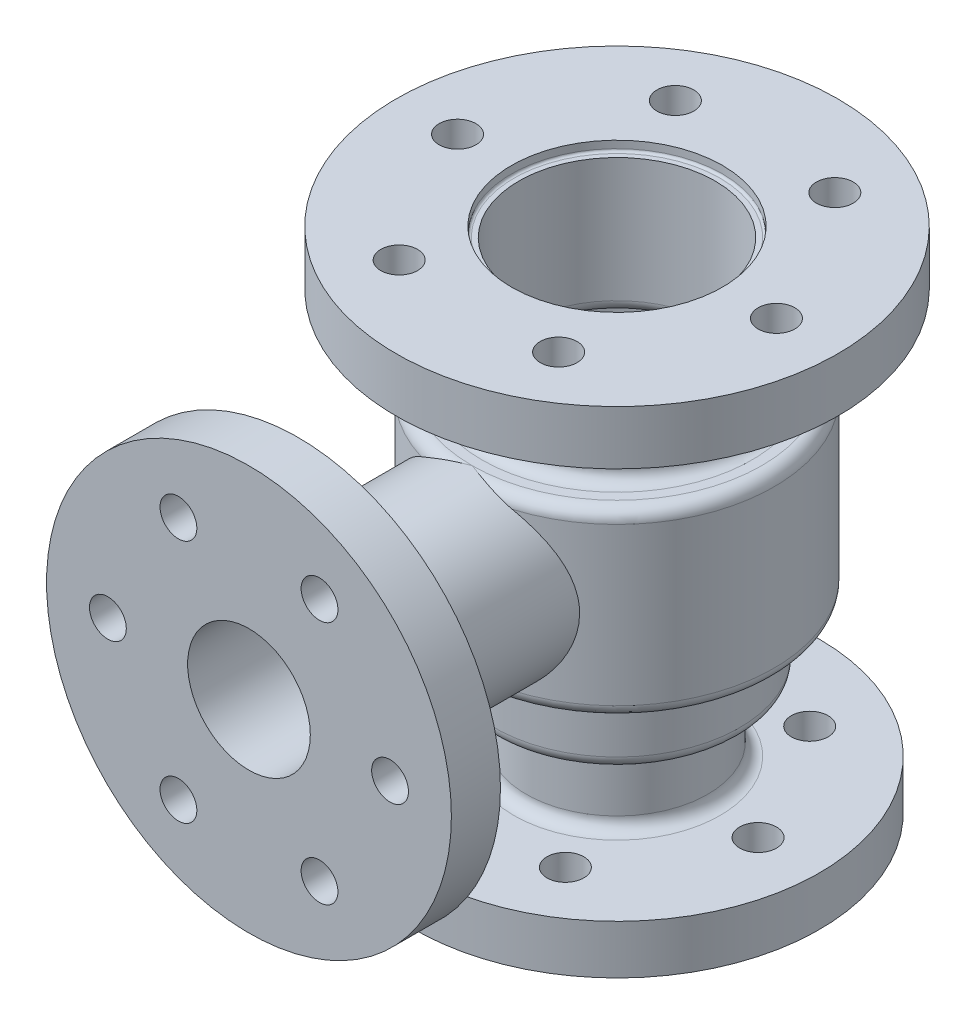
ISO-10303-21;
HEADER;
FILE_DESCRIPTION(('STEP AP214'),'2;1');
FILE_NAME('part.step','',(''),(''),'','','');
FILE_SCHEMA(('AUTOMOTIVE_DESIGN { 1 0 10303 214 1 1 1 1 }'));
ENDSEC;
DATA;
#1=APPLICATION_CONTEXT('core data for automotive mechanical design processes');
#2=APPLICATION_PROTOCOL_DEFINITION('international standard','automotive_design',2000,#1);
#3=PRODUCT_CONTEXT('',#1,'mechanical');
#4=PRODUCT('Part','Part','',(#3));
#5=PRODUCT_RELATED_PRODUCT_CATEGORY('part','',(#4));
#6=PRODUCT_DEFINITION_FORMATION('','',#4);
#7=PRODUCT_DEFINITION_CONTEXT('part definition',#1,'design');
#8=PRODUCT_DEFINITION('design','',#6,#7);
#9=PRODUCT_DEFINITION_SHAPE('','',#8);
#10=(LENGTH_UNIT() NAMED_UNIT(*) SI_UNIT(.MILLI.,.METRE.));
#11=(NAMED_UNIT(*) PLANE_ANGLE_UNIT() SI_UNIT($,.RADIAN.));
#12=(NAMED_UNIT(*) SI_UNIT($,.STERADIAN.) SOLID_ANGLE_UNIT());
#13=UNCERTAINTY_MEASURE_WITH_UNIT(LENGTH_MEASURE(1.E-05),#10,'distance_accuracy_value','');
#14=(GEOMETRIC_REPRESENTATION_CONTEXT(3) GLOBAL_UNCERTAINTY_ASSIGNED_CONTEXT((#13)) GLOBAL_UNIT_ASSIGNED_CONTEXT((#10,
#11,#12)) REPRESENTATION_CONTEXT('',''));
#15=CARTESIAN_POINT('',(0.,0.,0.));
#16=DIRECTION('',(0.,0.,1.));
#17=DIRECTION('',(1.,0.,0.));
#18=AXIS2_PLACEMENT_3D('',#15,#16,#17);
#19=CARTESIAN_POINT('',(0.,-30.7407284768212,0.));
#20=DIRECTION('',(0.,-1.,0.));
#21=DIRECTION('',(0.,0.,-1.));
#22=AXIS2_PLACEMENT_3D('',#19,#20,#21);
#23=CYLINDRICAL_SURFACE('',#22,46.);
#24=CARTESIAN_POINT('',(0.,147.466520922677,0.));
#25=DIRECTION('',(0.,-1.,0.));
#26=DIRECTION('',(0.,0.,-1.));
#27=AXIS2_PLACEMENT_3D('',#24,#25,#26);
#28=CIRCLE('',#27,46.);
#29=CARTESIAN_POINT('',(0.,147.466520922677,-46.));
#30=VERTEX_POINT('',#29);
#31=EDGE_CURVE('E643',#30,#30,#28,.T.);
#32=ORIENTED_EDGE('',*,*,#31,.F.);
#33=EDGE_LOOP('',(#32));
#34=FACE_BOUND('',#33,.T.);
#35=CARTESIAN_POINT('',(0.,89.9192284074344,0.));
#36=DIRECTION('',(0.,-1.,0.));
#37=DIRECTION('',(0.,0.,-1.));
#38=AXIS2_PLACEMENT_3D('',#35,#36,#37);
#39=CIRCLE('',#38,46.);
#40=CARTESIAN_POINT('',(0.,89.9192284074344,-46.));
#41=VERTEX_POINT('',#40);
#42=EDGE_CURVE('E652',#41,#41,#39,.T.);
#43=ORIENTED_EDGE('',*,*,#42,.T.);
#44=EDGE_LOOP('',(#43));
#45=FACE_BOUND('',#44,.T.);
#46=CARTESIAN_POINT('',(25.,115.,38.6134691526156));
#47=CARTESIAN_POINT('',(25.0000051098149,115.642381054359,38.6134624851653));
#48=CARTESIAN_POINT('',(24.9752114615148,116.284704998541,38.6295513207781));
#49=CARTESIAN_POINT('',(24.8764267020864,117.564213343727,38.6932407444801));
#50=CARTESIAN_POINT('',(24.8024185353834,118.20139588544,38.7408522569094));
#51=CARTESIAN_POINT('',(24.606154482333,119.46625783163,38.8658028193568));
#52=CARTESIAN_POINT('',(24.4838267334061,120.093921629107,38.9431861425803));
#53=CARTESIAN_POINT('',(24.1926135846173,121.334295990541,39.1247596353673));
#54=CARTESIAN_POINT('',(24.0237309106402,121.947007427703,39.2289482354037));
#55=CARTESIAN_POINT('',(23.6425912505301,123.150069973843,39.4598167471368));
#56=CARTESIAN_POINT('',(23.4306082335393,123.740535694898,39.5863539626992));
#57=CARTESIAN_POINT('',(22.9647179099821,124.900111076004,39.8584300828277));
#58=CARTESIAN_POINT('',(22.7108101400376,125.469220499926,40.0039691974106));
#59=CARTESIAN_POINT('',(22.163106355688,126.583707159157,40.309987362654));
#60=CARTESIAN_POINT('',(21.8693091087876,127.129083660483,40.470466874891));
#61=CARTESIAN_POINT('',(21.2437277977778,128.194147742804,40.8023209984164));
#62=CARTESIAN_POINT('',(20.9119400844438,128.713832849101,40.973696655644));
#63=CARTESIAN_POINT('',(20.1776575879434,129.775614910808,41.3406182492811));
#64=CARTESIAN_POINT('',(19.7714171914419,130.314876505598,41.5368821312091));
#65=CARTESIAN_POINT('',(18.9173651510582,131.358110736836,41.9327418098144));
#66=CARTESIAN_POINT('',(18.4695514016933,131.862081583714,42.1323377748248));
#67=CARTESIAN_POINT('',(17.5341190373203,132.83281306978,42.5301433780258));
#68=CARTESIAN_POINT('',(17.0464787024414,133.299553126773,42.7283521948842));
#69=CARTESIAN_POINT('',(16.0336380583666,134.193191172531,43.1186388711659));
#70=CARTESIAN_POINT('',(15.508436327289,134.620087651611,43.3107164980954));
#71=CARTESIAN_POINT('',(14.3773189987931,135.465381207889,43.6998800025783));
#72=CARTESIAN_POINT('',(13.7683252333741,135.880096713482,43.8960464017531));
#73=CARTESIAN_POINT('',(12.5119986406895,136.656294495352,44.2705264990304));
#74=CARTESIAN_POINT('',(11.8646631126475,137.017773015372,44.4488389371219));
#75=CARTESIAN_POINT('',(10.5359749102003,137.683585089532,44.7823855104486));
#76=CARTESIAN_POINT('',(9.85464183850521,137.98795110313,44.9376327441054));
#77=CARTESIAN_POINT('',(8.46247965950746,138.536054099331,45.2204676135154));
#78=CARTESIAN_POINT('',(7.75165438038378,138.7797989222,45.3480588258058));
#79=CARTESIAN_POINT('',(6.36530089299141,139.185973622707,45.5624197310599));
#80=CARTESIAN_POINT('',(5.69162292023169,139.353414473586,45.6516702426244));
#81=CARTESIAN_POINT('',(4.32952826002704,139.632058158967,45.8009214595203));
#82=CARTESIAN_POINT('',(3.64111230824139,139.743263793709,45.8609236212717));
#83=CARTESIAN_POINT('',(2.25583129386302,139.907779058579,45.9498930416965));
#84=CARTESIAN_POINT('',(1.55897171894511,139.961124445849,45.9788794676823));
#85=CARTESIAN_POINT('',(0.162657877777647,140.009226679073,46.00501038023));
#86=CARTESIAN_POINT('',(-0.536796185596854,140.003988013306,46.0021573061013));
#87=CARTESIAN_POINT('',(-1.86039572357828,139.938564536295,45.9666337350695));
#88=CARTESIAN_POINT('',(-2.48491511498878,139.884063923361,45.9370479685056));
#89=CARTESIAN_POINT('',(-3.72640781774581,139.728630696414,45.853035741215));
#90=CARTESIAN_POINT('',(-4.34338175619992,139.627701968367,45.7986113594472));
#91=CARTESIAN_POINT('',(-5.56561420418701,139.380580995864,45.6662004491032));
#92=CARTESIAN_POINT('',(-6.17087230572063,139.234387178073,45.5882131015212));
#93=CARTESIAN_POINT('',(-7.36585178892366,138.898315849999,45.4104522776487));
#94=CARTESIAN_POINT('',(-7.95557257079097,138.708436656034,45.3106779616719));
#95=CARTESIAN_POINT('',(-9.12257869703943,138.284507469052,45.0902998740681));
#96=CARTESIAN_POINT('',(-9.69965121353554,138.049987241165,44.9694756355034));
#97=CARTESIAN_POINT('',(-10.8314442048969,137.540298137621,44.7103666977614));
#98=CARTESIAN_POINT('',(-11.3861647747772,137.26512943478,44.5720820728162));
#99=CARTESIAN_POINT('',(-12.4708445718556,136.676230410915,44.2808475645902));
#100=CARTESIAN_POINT('',(-13.000798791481,136.36249233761,44.1278947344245));
#101=CARTESIAN_POINT('',(-14.033729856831,135.698585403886,43.8103464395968));
#102=CARTESIAN_POINT('',(-14.5367042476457,135.348413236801,43.6457499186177));
#103=CARTESIAN_POINT('',(-15.5657347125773,134.57460495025,43.2901239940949));
#104=CARTESIAN_POINT('',(-16.0885688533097,134.14711635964,43.0981438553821));
#105=CARTESIAN_POINT('',(-17.0967800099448,133.25251760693,42.7082231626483));
#106=CARTESIAN_POINT('',(-17.5821547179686,132.785405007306,42.510282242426));
#107=CARTESIAN_POINT('',(-18.5138526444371,131.813413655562,42.1128721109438));
#108=CARTESIAN_POINT('',(-18.9601387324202,131.308499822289,41.9134016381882));
#109=CARTESIAN_POINT('',(-19.8111306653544,130.263460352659,41.5179394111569));
#110=CARTESIAN_POINT('',(-20.2158347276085,129.723333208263,41.3219478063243));
#111=CARTESIAN_POINT('',(-21.0139171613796,128.562896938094,40.9222548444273));
#112=CARTESIAN_POINT('',(-21.4034428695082,127.939669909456,40.7193033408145));
#113=CARTESIAN_POINT('',(-22.1280619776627,126.657242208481,40.3301142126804));
#114=CARTESIAN_POINT('',(-22.4631510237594,125.998038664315,40.1438779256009));
#115=CARTESIAN_POINT('',(-23.0752649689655,124.647848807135,39.7951780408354));
#116=CARTESIAN_POINT('',(-23.3523431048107,123.956892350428,39.632692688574));
#117=CARTESIAN_POINT('',(-23.8452737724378,122.547196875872,39.3380928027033));
#118=CARTESIAN_POINT('',(-24.0611360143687,121.828462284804,39.2059734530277));
#119=CARTESIAN_POINT('',(-24.4134012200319,120.428084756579,38.9875015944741));
#120=CARTESIAN_POINT('',(-24.554821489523,119.748148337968,38.8983102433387));
#121=CARTESIAN_POINT('',(-24.7808709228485,118.375240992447,38.7546964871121));
#122=CARTESIAN_POINT('',(-24.8655036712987,117.682270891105,38.7002718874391));
#123=CARTESIAN_POINT('',(-24.97642673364,116.290382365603,38.628778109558));
#124=CARTESIAN_POINT('',(-25.0027704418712,115.591469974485,38.6116747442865));
#125=CARTESIAN_POINT('',(-24.9967694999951,114.19404079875,38.6155614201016));
#126=CARTESIAN_POINT('',(-24.9644308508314,113.495523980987,38.636547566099));
#127=CARTESIAN_POINT('',(-24.8503394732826,112.203524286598,38.7100027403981));
#128=CARTESIAN_POINT('',(-24.7761683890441,111.609073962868,38.7576337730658));
#129=CARTESIAN_POINT('',(-24.5859422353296,110.429642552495,38.8785822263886));
#130=CARTESIAN_POINT('',(-24.4698919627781,109.844660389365,38.9518967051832));
#131=CARTESIAN_POINT('',(-24.1972344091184,108.68752330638,39.1218556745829));
#132=CARTESIAN_POINT('',(-24.0406135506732,108.115372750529,39.2185079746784));
#133=CARTESIAN_POINT('',(-23.6884502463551,106.987094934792,39.4322165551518));
#134=CARTESIAN_POINT('',(-23.4929051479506,106.430968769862,39.5492742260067));
#135=CARTESIAN_POINT('',(-23.0554172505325,105.313776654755,39.8059637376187));
#136=CARTESIAN_POINT('',(-22.8118426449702,104.753524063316,39.946349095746));
#137=CARTESIAN_POINT('',(-22.2861434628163,103.655467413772,40.2420019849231));
#138=CARTESIAN_POINT('',(-22.0040149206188,103.117665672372,40.3972710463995));
#139=CARTESIAN_POINT('',(-21.4029424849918,102.066290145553,40.718917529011));
#140=CARTESIAN_POINT('',(-21.0839862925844,101.552724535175,40.8852986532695));
#141=CARTESIAN_POINT('',(-20.4110046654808,100.551653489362,41.2253932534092));
#142=CARTESIAN_POINT('',(-20.0569766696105,100.064149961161,41.3991072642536));
#143=CARTESIAN_POINT('',(-19.2582290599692,99.0437283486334,41.7773231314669));
#144=CARTESIAN_POINT('',(-18.8079406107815,98.5153868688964,41.9824446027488));
#145=CARTESIAN_POINT('',(-17.8649212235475,97.4978332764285,42.3923217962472));
#146=CARTESIAN_POINT('',(-17.3721865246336,97.0086246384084,42.5970774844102));
#147=CARTESIAN_POINT('',(-16.3462054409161,96.0715968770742,43.0012288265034));
#148=CARTESIAN_POINT('',(-15.812937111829,95.6238004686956,43.2006214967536));
#149=CARTESIAN_POINT('',(-14.7084810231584,94.7726260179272,43.5890267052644));
#150=CARTESIAN_POINT('',(-14.1372931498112,94.3692481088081,43.7780392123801));
#151=CARTESIAN_POINT('',(-12.9318918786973,93.5919566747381,44.1495449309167));
#152=CARTESIAN_POINT('',(-12.2959770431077,93.2203262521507,44.3313116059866));
#153=CARTESIAN_POINT('',(-10.989137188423,92.5326009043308,44.6732020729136));
#154=CARTESIAN_POINT('',(-10.3182103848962,92.2165088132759,44.8333247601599));
#155=CARTESIAN_POINT('',(-8.94646660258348,91.6437878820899,45.1270677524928));
#156=CARTESIAN_POINT('',(-8.24567480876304,91.3871100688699,45.2607098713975));
#157=CARTESIAN_POINT('',(-6.81923759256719,90.9363924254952,45.4974766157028));
#158=CARTESIAN_POINT('',(-6.09359578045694,90.7423435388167,45.6006056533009));
#159=CARTESIAN_POINT('',(-4.6980336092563,90.4360787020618,45.7643014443));
#160=CARTESIAN_POINT('',(-4.02986529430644,90.3175876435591,45.8281096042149));
#161=CARTESIAN_POINT('',(-2.68399095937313,90.1352213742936,45.9265858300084));
#162=CARTESIAN_POINT('',(-2.00628559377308,90.0713424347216,45.9612558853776));
#163=CARTESIAN_POINT('',(-0.647338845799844,89.9991244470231,46.0004659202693));
#164=CARTESIAN_POINT('',(0.0339009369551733,89.9907621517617,46.0050185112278));
#165=CARTESIAN_POINT('',(1.39430406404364,90.029639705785,45.9838951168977));
#166=CARTESIAN_POINT('',(2.07346750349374,90.0768769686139,45.9582205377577));
#167=CARTESIAN_POINT('',(3.36564049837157,90.2198081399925,45.8808749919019));
#168=CARTESIAN_POINT('',(3.97930447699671,90.3109723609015,45.8316366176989));
#169=CARTESIAN_POINT('',(5.19586700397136,90.5380741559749,45.709699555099));
#170=CARTESIAN_POINT('',(5.79876633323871,90.6740084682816,45.6370025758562));
#171=CARTESIAN_POINT('',(6.99004448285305,90.9891906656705,45.4697826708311));
#172=CARTESIAN_POINT('',(7.57842242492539,91.1684411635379,45.3752584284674));
#173=CARTESIAN_POINT('',(8.73726492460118,91.5684829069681,45.1664355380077));
#174=CARTESIAN_POINT('',(9.30772862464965,91.7892761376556,45.0521359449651));
#175=CARTESIAN_POINT('',(10.4477312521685,92.279010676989,44.8017578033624));
#176=CARTESIAN_POINT('',(11.0165152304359,92.5493854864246,44.6650490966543));
#177=CARTESIAN_POINT('',(12.1289528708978,93.1303335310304,44.3758814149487));
#178=CARTESIAN_POINT('',(12.6726062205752,93.4409072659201,44.2234222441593));
#179=CARTESIAN_POINT('',(13.7326230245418,94.1001258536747,43.9058230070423));
#180=CARTESIAN_POINT('',(14.2489787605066,94.4487813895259,43.7406793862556));
#181=CARTESIAN_POINT('',(15.2523092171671,95.1819975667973,43.4010098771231));
#182=CARTESIAN_POINT('',(15.7392808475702,95.5665619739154,43.2264830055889));
#183=CARTESIAN_POINT('',(16.73550375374,96.4151097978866,42.8513399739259));
#184=CARTESIAN_POINT('',(17.2410314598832,96.8831550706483,42.6500077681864));
#185=CARTESIAN_POINT('',(18.21131531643,97.8587804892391,42.2448160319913));
#186=CARTESIAN_POINT('',(18.6760683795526,98.3663636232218,42.0409563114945));
#187=CARTESIAN_POINT('',(19.5631633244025,99.4193358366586,41.6355706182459));
#188=CARTESIAN_POINT('',(19.985454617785,99.964768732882,41.4340476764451));
#189=CARTESIAN_POINT('',(20.7847150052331,101.090572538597,41.0389374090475));
#190=CARTESIAN_POINT('',(21.1616863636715,101.670941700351,40.8453496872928));
#191=CARTESIAN_POINT('',(21.8896505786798,102.901038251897,40.4601421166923));
#192=CARTESIAN_POINT('',(22.2376115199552,103.552835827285,40.2693784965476));
#193=CARTESIAN_POINT('',(22.8764965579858,104.889862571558,39.9099034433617));
#194=CARTESIAN_POINT('',(23.1674108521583,105.575097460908,39.7411958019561));
#195=CARTESIAN_POINT('',(23.6878999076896,106.972686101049,39.4331678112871));
#196=CARTESIAN_POINT('',(23.9176442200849,107.684958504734,39.2937664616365));
#197=CARTESIAN_POINT('',(24.31326782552,109.132510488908,39.0502130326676));
#198=CARTESIAN_POINT('',(24.4791884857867,109.867774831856,38.946038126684));
#199=CARTESIAN_POINT('',(24.7403209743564,111.332201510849,38.7806619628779));
#200=CARTESIAN_POINT('',(24.8375295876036,112.06086948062,38.7182502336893));
#201=CARTESIAN_POINT('',(24.9673663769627,113.526383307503,38.6346575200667));
#202=CARTESIAN_POINT('',(24.9999941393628,114.263229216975,38.6134767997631));
#203=CARTESIAN_POINT('',(25.,115.,38.6134691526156));
#204=B_SPLINE_CURVE_WITH_KNOTS('',3,(#46,#47,#48,#49,#50,#51,#52,#53,#54,#55,#56,#57,#58,#59,
#60,#61,#62,#63,#64,#65,#66,#67,#68,#69,#70,#71,#72,#73,#74,#75,#76,#77,#78,#79,#80,#81,#82,#83,
#84,#85,#86,#87,#88,#89,#90,#91,#92,#93,#94,#95,#96,#97,#98,#99,#100,#101,#102,#103,#104,#105,
#106,#107,#108,#109,#110,#111,#112,#113,#114,#115,#116,#117,#118,#119,#120,#121,#122,#123,#124,
#125,#126,#127,#128,#129,#130,#131,#132,#133,#134,#135,#136,#137,#138,#139,#140,#141,#142,#143,
#144,#145,#146,#147,#148,#149,#150,#151,#152,#153,#154,#155,#156,#157,#158,#159,#160,#161,#162,
#163,#164,#165,#166,#167,#168,#169,#170,#171,#172,#173,#174,#175,#176,#177,#178,#179,#180,#181,
#182,#183,#184,#185,#186,#187,#188,#189,#190,#191,#192,#193,#194,#195,#196,#197,#198,#199,#200,
#201,#202,#203),.UNSPECIFIED.,.T.,.F.,(4,2,2,2,2,2,2,2,2,2,2,2,2,2,2,2,2,2,2,2,2,2,2,2,2,2,2,2,
2,2,2,2,2,2,2,2,2,2,2,2,2,2,2,2,2,2,2,2,2,2,2,2,2,2,2,2,2,2,2,2,2,2,2,2,2,2,2,2,2,2,2,2,2,2,2,2,
2,2,4),(0.,1.92637335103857,3.85341464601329,5.78333276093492,7.71313789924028,9.63103951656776,
11.5489623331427,13.4669444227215,15.3851109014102,17.4922362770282,19.5994684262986,
21.7078575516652,23.8163265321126,26.1007322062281,28.3852989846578,30.6685633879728,
32.9515323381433,35.048284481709,37.1449322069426,39.2402834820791,41.3354742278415,
43.216013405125,45.0963952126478,46.9768423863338,48.85736204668,50.7589124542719,
52.6604547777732,54.5623799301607,56.4644778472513,58.5685885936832,60.6728288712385,
62.779046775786,64.8853549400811,67.1698034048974,69.4544344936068,71.7369596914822,
74.0191226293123,76.1165649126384,78.213874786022,80.3092626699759,82.4044362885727,
84.205216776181,86.0057910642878,87.8069687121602,89.6082691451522,91.4869200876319,
93.3657644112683,95.2452380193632,97.1248489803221,99.2940781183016,101.463499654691,
103.634104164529,105.804715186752,108.077577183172,110.350555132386,112.62165282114,
114.892421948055,116.934403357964,118.976245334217,121.017232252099,123.058124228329,
124.923028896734,126.787797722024,128.652679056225,130.517649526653,132.448970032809,
134.380314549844,136.312202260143,138.244292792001,140.395215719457,142.546301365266,
144.699920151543,146.853431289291,149.139634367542,151.426229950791,153.70641996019,
155.985129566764,158.194544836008,160.403974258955),.UNSPECIFIED.);
#205=CARTESIAN_POINT('',(25.,115.,38.6134691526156));
#206=VERTEX_POINT('',#205);
#207=EDGE_CURVE('E183',#206,#206,#204,.T.);
#208=ORIENTED_EDGE('',*,*,#207,.T.);
#209=EDGE_LOOP('',(#208));
#210=FACE_BOUND('',#209,.T.);
#211=ADVANCED_FACE('F32',(#34,#45,#210),#23,.F.);
#212=CARTESIAN_POINT('',(0.,197.5,150.));
#213=DIRECTION('',(0.,0.,-1.));
#214=DIRECTION('',(-1.,0.,0.));
#215=AXIS2_PLACEMENT_3D('',#212,#213,#214);
#216=PLANE('',#215);
#217=CARTESIAN_POINT('',(-28.7500000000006,65.2035392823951,149.99999999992));
#218=DIRECTION('',(0.,0.,1.));
#219=DIRECTION('',(0.50000000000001,0.866025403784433,0.));
#220=AXIS2_PLACEMENT_3D('',#217,#218,#219);
#221=CIRCLE('',#220,7.5);
#222=CARTESIAN_POINT('',(-25.0000000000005,71.6987298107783,149.99999999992));
#223=VERTEX_POINT('',#222);
#224=EDGE_CURVE('E146',#223,#223,#221,.T.);
#225=ORIENTED_EDGE('',*,*,#224,.F.);
#226=EDGE_LOOP('',(#225));
#227=FACE_BOUND('',#226,.T.);
#228=CARTESIAN_POINT('',(28.7499999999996,65.2035392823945,149.99999999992));
#229=DIRECTION('',(0.,0.,1.));
#230=DIRECTION('',(-0.499999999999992,0.866025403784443,0.));
#231=AXIS2_PLACEMENT_3D('',#228,#229,#230);
#232=CIRCLE('',#231,7.5);
#233=CARTESIAN_POINT('',(24.9999999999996,71.6987298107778,149.99999999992));
#234=VERTEX_POINT('',#233);
#235=EDGE_CURVE('E143',#234,#234,#232,.T.);
#236=ORIENTED_EDGE('',*,*,#235,.F.);
#237=EDGE_LOOP('',(#236));
#238=FACE_BOUND('',#237,.T.);
#239=CARTESIAN_POINT('',(57.5,115.,149.99999999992));
#240=DIRECTION('',(0.,0.,1.));
#241=DIRECTION('',(-1.,0.,0.));
#242=AXIS2_PLACEMENT_3D('',#239,#240,#241);
#243=CIRCLE('',#242,7.5);
#244=CARTESIAN_POINT('',(50.,115.,149.99999999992));
#245=VERTEX_POINT('',#244);
#246=EDGE_CURVE('E139',#245,#245,#243,.T.);
#247=ORIENTED_EDGE('',*,*,#246,.F.);
#248=EDGE_LOOP('',(#247));
#249=FACE_BOUND('',#248,.T.);
#250=CARTESIAN_POINT('',(28.7500000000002,164.796460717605,149.99999999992));
#251=DIRECTION('',(0.,0.,1.));
#252=DIRECTION('',(-0.500000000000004,-0.866025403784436,0.));
#253=AXIS2_PLACEMENT_3D('',#250,#251,#252);
#254=CIRCLE('',#253,7.5);
#255=CARTESIAN_POINT('',(25.0000000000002,158.301270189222,149.99999999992));
#256=VERTEX_POINT('',#255);
#257=EDGE_CURVE('E135',#256,#256,#254,.T.);
#258=ORIENTED_EDGE('',*,*,#257,.F.);
#259=EDGE_LOOP('',(#258));
#260=FACE_BOUND('',#259,.T.);
#261=CARTESIAN_POINT('',(-28.7499999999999,164.796460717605,149.99999999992));
#262=DIRECTION('',(0.,0.,1.));
#263=DIRECTION('',(0.499999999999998,-0.86602540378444,0.));
#264=AXIS2_PLACEMENT_3D('',#261,#262,#263);
#265=CIRCLE('',#264,7.5);
#266=CARTESIAN_POINT('',(-24.9999999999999,158.301270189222,149.99999999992));
#267=VERTEX_POINT('',#266);
#268=EDGE_CURVE('E131',#267,#267,#265,.T.);
#269=ORIENTED_EDGE('',*,*,#268,.F.);
#270=EDGE_LOOP('',(#269));
#271=FACE_BOUND('',#270,.T.);
#272=CARTESIAN_POINT('',(-57.5,115.,149.99999999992));
#273=DIRECTION('',(0.,0.,1.));
#274=DIRECTION('',(1.,0.,0.));
#275=AXIS2_PLACEMENT_3D('',#272,#273,#274);
#276=CIRCLE('',#275,7.5);
#277=CARTESIAN_POINT('',(-50.,115.,149.99999999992));
#278=VERTEX_POINT('',#277);
#279=EDGE_CURVE('E127',#278,#278,#276,.T.);
#280=ORIENTED_EDGE('',*,*,#279,.F.);
#281=EDGE_LOOP('',(#280));
#282=FACE_BOUND('',#281,.T.);
#283=CARTESIAN_POINT('',(0.,115.,150.));
#284=DIRECTION('',(0.,0.,1.));
#285=DIRECTION('',(1.,0.,0.));
#286=AXIS2_PLACEMENT_3D('',#283,#284,#285);
#287=CIRCLE('',#286,82.5);
#288=CARTESIAN_POINT('',(82.5,115.,150.));
#289=VERTEX_POINT('',#288);
#290=EDGE_CURVE('E70',#289,#289,#287,.T.);
#291=ORIENTED_EDGE('',*,*,#290,.T.);
#292=EDGE_LOOP('',(#291));
#293=FACE_BOUND('',#292,.T.);
#294=CARTESIAN_POINT('',(0.,115.,150.));
#295=DIRECTION('',(0.,0.,1.));
#296=DIRECTION('',(1.,0.,0.));
#297=AXIS2_PLACEMENT_3D('',#294,#295,#296);
#298=CIRCLE('',#297,25.);
#299=CARTESIAN_POINT('',(25.,115.,150.));
#300=VERTEX_POINT('',#299);
#301=EDGE_CURVE('E191',#300,#300,#298,.T.);
#302=ORIENTED_EDGE('',*,*,#301,.F.);
#303=EDGE_LOOP('',(#302));
#304=FACE_BOUND('',#303,.T.);
#305=ADVANCED_FACE('F164',(#227,#238,#249,#260,#271,#282,#293,#304),#216,.F.);
#306=CARTESIAN_POINT('',(0.,147.,0.));
#307=DIRECTION('',(0.,-1.,0.));
#308=DIRECTION('',(0.,0.,-1.));
#309=AXIS2_PLACEMENT_3D('',#306,#307,#308);
#310=TOROIDAL_SURFACE('',#309,59.,5.);
#311=CARTESIAN_POINT('',(0.,152.,0.));
#312=DIRECTION('',(0.,-1.,0.));
#313=DIRECTION('',(0.,0.,-1.));
#314=AXIS2_PLACEMENT_3D('',#311,#312,#313);
#315=CIRCLE('',#314,59.);
#316=CARTESIAN_POINT('',(0.,152.,59.));
#317=VERTEX_POINT('',#316);
#318=EDGE_CURVE('E92',#317,#317,#315,.T.);
#319=ORIENTED_EDGE('',*,*,#318,.T.);
#320=CARTESIAN_POINT('',(0.,152.,59.));
#321=CARTESIAN_POINT('',(0.012036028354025,152.000000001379,59.0044245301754));
#322=CARTESIAN_POINT('',(0.0240733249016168,151.999994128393,59.008845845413));
#323=CARTESIAN_POINT('',(0.830709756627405,151.99920676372,59.3048771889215));
#324=CARTESIAN_POINT('',(1.63080853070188,151.972823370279,59.582431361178));
#325=CARTESIAN_POINT('',(3.23933319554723,151.866744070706,60.1025952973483));
#326=CARTESIAN_POINT('',(4.04776399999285,151.787014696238,60.3451830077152));
#327=CARTESIAN_POINT('',(5.6704637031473,151.572075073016,60.7880266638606));
#328=CARTESIAN_POINT('',(6.48473998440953,151.436774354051,60.9882127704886));
#329=CARTESIAN_POINT('',(8.11270852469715,151.10917314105,61.3368404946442));
#330=CARTESIAN_POINT('',(8.92640083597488,150.916907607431,61.4853137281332));
#331=CARTESIAN_POINT('',(10.2809163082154,150.547451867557,61.6817454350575));
#332=CARTESIAN_POINT('',(10.8236282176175,150.386032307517,61.7467002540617));
#333=CARTESIAN_POINT('',(11.9037370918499,150.037450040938,61.8451287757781));
#334=CARTESIAN_POINT('',(12.441133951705,149.850286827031,61.8786018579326));
#335=CARTESIAN_POINT('',(13.5056628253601,149.451688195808,61.9100723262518));
#336=CARTESIAN_POINT('',(14.032826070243,149.240347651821,61.908203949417));
#337=CARTESIAN_POINT('',(15.0753358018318,148.794311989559,61.8650719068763));
#338=CARTESIAN_POINT('',(15.5906875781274,148.559627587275,61.8238262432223));
#339=CARTESIAN_POINT('',(16.5993757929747,148.072195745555,61.6981327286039));
#340=CARTESIAN_POINT('',(17.0929101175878,147.819719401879,61.6142472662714));
#341=CARTESIAN_POINT('',(17.8188433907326,147.42784129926,61.4526332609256));
#342=CARTESIAN_POINT('',(18.058752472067,147.29482568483,61.3926884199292));
#343=CARTESIAN_POINT('',(18.5330455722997,147.02500264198,61.2601985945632));
#344=CARTESIAN_POINT('',(18.7674269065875,146.888193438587,61.1876476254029));
#345=CARTESIAN_POINT('',(18.9986894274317,146.7498,61.1084941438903));
#346=B_SPLINE_CURVE_WITH_KNOTS('',3,(#320,#321,#322,#323,#324,#325,#326,#327,#328,#329,#330,
#331,#332,#333,#334,#335,#336,#337,#338,#339,#340,#341,#342,#343,#344,#345),.UNSPECIFIED.,.F.,
.F.,(4,2,2,2,2,2,2,2,2,2,2,2,4),(0.,0.0384707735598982,2.57771108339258,5.11854596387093,
7.66353382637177,10.2069630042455,11.915445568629,13.6239618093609,15.3259899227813,
17.0272402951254,18.7066130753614,19.5486624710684,20.3911127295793),.UNSPECIFIED.);
#347=CARTESIAN_POINT('',(18.5741756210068,147.,61.2454079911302));
#348=VERTEX_POINT('',#347);
#349=EDGE_CURVE('E227',#317,#348,#346,.T.);
#350=ORIENTED_EDGE('',*,*,#349,.T.);
#351=CARTESIAN_POINT('',(0.,147.,0.));
#352=DIRECTION('',(0.,-1.,0.));
#353=DIRECTION('',(0.,0.,-1.));
#354=AXIS2_PLACEMENT_3D('',#351,#352,#353);
#355=CIRCLE('',#354,64.);
#356=CARTESIAN_POINT('',(-18.5741756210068,147.,61.2454079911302));
#357=VERTEX_POINT('',#356);
#358=EDGE_CURVE('E83',#357,#348,#355,.T.);
#359=ORIENTED_EDGE('',*,*,#358,.F.);
#360=CARTESIAN_POINT('',(-18.9986894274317,146.7498,61.1084941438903));
#361=CARTESIAN_POINT('',(-18.8240874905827,146.854282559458,61.1682575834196));
#362=CARTESIAN_POINT('',(-18.6476986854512,146.957872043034,61.2242570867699));
#363=CARTESIAN_POINT('',(-18.2916322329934,147.162996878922,61.3289918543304));
#364=CARTESIAN_POINT('',(-18.1119550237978,147.264532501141,61.3777280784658));
#365=CARTESIAN_POINT('',(-17.5687730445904,147.565462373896,61.5133532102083));
#366=CARTESIAN_POINT('',(-17.2007071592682,147.761425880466,61.5897974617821));
#367=CARTESIAN_POINT('',(-16.4567699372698,148.141337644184,61.716479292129));
#368=CARTESIAN_POINT('',(-16.0809539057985,148.325347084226,61.7668613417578));
#369=CARTESIAN_POINT('',(-15.3211871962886,148.681410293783,61.8440577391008));
#370=CARTESIAN_POINT('',(-14.9372332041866,148.8534590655,61.8708622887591));
#371=CARTESIAN_POINT('',(-13.9509666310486,149.275277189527,61.9114711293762));
#372=CARTESIAN_POINT('',(-13.3441348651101,149.516058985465,61.9101356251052));
#373=CARTESIAN_POINT('',(-12.1201808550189,149.964647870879,61.8618726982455));
#374=CARTESIAN_POINT('',(-11.5030549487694,150.172442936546,61.8149286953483));
#375=CARTESIAN_POINT('',(-10.2604966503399,150.554834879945,61.6809504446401));
#376=CARTESIAN_POINT('',(-9.63504215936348,150.729307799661,61.5937704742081));
#377=CARTESIAN_POINT('',(-8.38155849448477,151.043960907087,61.3844679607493));
#378=CARTESIAN_POINT('',(-7.7535296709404,151.184145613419,61.2623500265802));
#379=CARTESIAN_POINT('',(-6.52958171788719,151.424351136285,60.9947531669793));
#380=CARTESIAN_POINT('',(-5.933659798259,151.526056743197,60.8507847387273));
#381=CARTESIAN_POINT('',(-4.74367300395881,151.699584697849,60.538973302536));
#382=CARTESIAN_POINT('',(-4.14960878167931,151.771397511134,60.3711227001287));
#383=CARTESIAN_POINT('',(-2.37517153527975,151.942758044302,59.837246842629));
#384=CARTESIAN_POINT('',(-1.19934931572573,151.9988461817,59.4401661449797));
#385=CARTESIAN_POINT('',(-0.0240732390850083,151.999994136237,59.0088458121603));
#386=CARTESIAN_POINT('',(-0.0120359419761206,152.000000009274,59.0044244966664));
#387=CARTESIAN_POINT('',(0.,152.,59.));
#388=B_SPLINE_CURVE_WITH_KNOTS('',3,(#360,#361,#362,#363,#364,#365,#366,#367,#368,#369,#370,
#371,#372,#373,#374,#375,#376,#377,#378,#379,#380,#381,#382,#383,#384,#385,#386,#387),
.UNSPECIFIED.,.F.,.F.,(4,2,2,2,2,2,2,2,2,2,2,2,2,4),(0.,0.636117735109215,1.27215132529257,
2.54272649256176,3.80618088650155,5.07016008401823,7.02578945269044,8.98213002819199,
10.9456121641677,12.9088354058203,14.7718543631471,16.6354670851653,20.352716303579,
20.3911870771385),.UNSPECIFIED.);
#389=EDGE_CURVE('E221',#357,#317,#388,.T.);
#390=ORIENTED_EDGE('',*,*,#389,.T.);
#391=EDGE_LOOP('',(#319,#350,#359,#390));
#392=FACE_BOUND('',#391,.T.);
#393=ADVANCED_FACE('F170',(#392),#310,.T.);
#394=CARTESIAN_POINT('',(0.,-30.7407284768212,0.));
#395=DIRECTION('',(0.,-1.,0.));
#396=DIRECTION('',(0.,0.,-1.));
#397=AXIS2_PLACEMENT_3D('',#394,#395,#396);
#398=CYLINDRICAL_SURFACE('',#397,64.);
#399=CARTESIAN_POINT('',(0.,83.,0.));
#400=DIRECTION('',(0.,-1.,0.));
#401=DIRECTION('',(0.,0.,-1.));
#402=AXIS2_PLACEMENT_3D('',#399,#400,#401);
#403=CIRCLE('',#402,64.);
#404=CARTESIAN_POINT('',(-18.5741756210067,83.,61.2454079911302));
#405=VERTEX_POINT('',#404);
#406=CARTESIAN_POINT('',(18.5741756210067,83.,61.2454079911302));
#407=VERTEX_POINT('',#406);
#408=EDGE_CURVE('E75',#405,#407,#403,.T.);
#409=ORIENTED_EDGE('',*,*,#408,.F.);
#410=CARTESIAN_POINT('',(37.,115.,52.2206855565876));
#411=CARTESIAN_POINT('',(36.9999980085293,114.061048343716,52.2206880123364));
#412=CARTESIAN_POINT('',(36.964202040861,113.122073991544,52.2461053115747));
#413=CARTESIAN_POINT('',(36.8216497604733,111.252263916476,52.3466672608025));
#414=CARTESIAN_POINT('',(36.7148907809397,110.321428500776,52.4218137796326));
#415=CARTESIAN_POINT('',(36.432002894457,108.474467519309,52.6188066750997));
#416=CARTESIAN_POINT('',(36.2558123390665,107.558355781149,52.740694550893));
#417=CARTESIAN_POINT('',(35.9415496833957,106.201079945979,52.9548942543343));
#418=CARTESIAN_POINT('',(35.8284553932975,105.751436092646,53.0315292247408));
#419=CARTESIAN_POINT('',(35.5859424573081,104.858262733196,53.1945682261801));
#420=CARTESIAN_POINT('',(35.4565206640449,104.414734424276,53.2809741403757));
#421=CARTESIAN_POINT('',(35.0462814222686,103.10057545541,53.5524543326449));
#422=CARTESIAN_POINT('',(34.7419826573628,102.23989525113,53.7508318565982));
#423=CARTESIAN_POINT('',(34.0736224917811,100.549583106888,54.1769796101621));
#424=CARTESIAN_POINT('',(33.7095537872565,99.7199549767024,54.404753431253));
#425=CARTESIAN_POINT('',(33.1209121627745,98.5012465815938,54.7636559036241));
#426=CARTESIAN_POINT('',(32.9175624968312,98.0992196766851,54.8861905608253));
#427=CARTESIAN_POINT('',(32.4970662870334,97.3041570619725,55.1361996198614));
#428=CARTESIAN_POINT('',(32.279923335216,96.9111190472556,55.2636727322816));
#429=CARTESIAN_POINT('',(31.6081605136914,95.7456918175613,55.6524198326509));
#430=CARTESIAN_POINT('',(31.1332151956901,94.9870070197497,55.9200163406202));
#431=CARTESIAN_POINT('',(30.0752887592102,93.4253842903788,56.4967224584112));
#432=CARTESIAN_POINT('',(29.4861644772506,92.6270886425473,56.8071127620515));
#433=CARTESIAN_POINT('',(28.2469381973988,91.0815638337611,57.4333741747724));
#434=CARTESIAN_POINT('',(27.5968328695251,90.3343374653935,57.7492455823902));
#435=CARTESIAN_POINT('',(26.2379527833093,88.8934668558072,58.3791999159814));
#436=CARTESIAN_POINT('',(25.5291412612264,88.1998567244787,58.6932815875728));
#437=CARTESIAN_POINT('',(24.0558758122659,86.8699504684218,59.3123372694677));
#438=CARTESIAN_POINT('',(23.291419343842,86.2336569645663,59.6173108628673));
#439=CARTESIAN_POINT('',(21.6321369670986,84.9625711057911,60.2404418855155));
#440=CARTESIAN_POINT('',(20.7318773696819,84.3340412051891,60.5569607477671));
#441=CARTESIAN_POINT('',(18.8721262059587,83.1557764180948,61.1620718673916));
#442=CARTESIAN_POINT('',(17.9126297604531,82.6060480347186,61.450661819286));
#443=CARTESIAN_POINT('',(15.9406530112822,81.5915565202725,61.9914511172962));
#444=CARTESIAN_POINT('',(14.9282074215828,81.1267385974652,62.2436739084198));
#445=CARTESIAN_POINT('',(12.8568807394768,80.2876296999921,62.7042707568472));
#446=CARTESIAN_POINT('',(11.7980066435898,79.9133251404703,62.9126513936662));
#447=CARTESIAN_POINT('',(9.73962345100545,79.2902008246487,63.262386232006));
#448=CARTESIAN_POINT('',(8.74335158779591,79.0331178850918,63.4080856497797));
#449=CARTESIAN_POINT('',(6.72737731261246,78.602135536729,63.653539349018));
#450=CARTESIAN_POINT('',(5.7076761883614,78.4282315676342,63.7532961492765));
#451=CARTESIAN_POINT('',(3.65444128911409,78.1663820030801,63.9038648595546));
#452=CARTESIAN_POINT('',(2.62091791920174,78.0783750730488,63.9547116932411));
#453=CARTESIAN_POINT('',(0.548918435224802,77.989547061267,64.0060328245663));
#454=CARTESIAN_POINT('',(-0.489557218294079,77.9887180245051,64.006511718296));
#455=CARTESIAN_POINT('',(-2.44184787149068,78.069270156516,63.9599723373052));
#456=CARTESIAN_POINT('',(-3.35620429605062,78.1411647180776,63.9184349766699));
#457=CARTESIAN_POINT('',(-5.17446841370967,78.3521850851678,63.7969815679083));
#458=CARTESIAN_POINT('',(-6.07837709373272,78.4913044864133,63.7170691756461));
#459=CARTESIAN_POINT('',(-7.86959147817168,78.8350815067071,63.5207167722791));
#460=CARTESIAN_POINT('',(-8.75689662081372,79.0397413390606,63.4042755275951));
#461=CARTESIAN_POINT('',(-10.5092810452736,79.5122747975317,63.1374740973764));
#462=CARTESIAN_POINT('',(-11.3743594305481,79.7801509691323,62.98711254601));
#463=CARTESIAN_POINT('',(-13.084240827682,80.3787656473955,62.6543492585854));
#464=CARTESIAN_POINT('',(-13.9288221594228,80.7099969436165,62.4716972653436));
#465=CARTESIAN_POINT('',(-15.5860415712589,81.4307898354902,62.0789864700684));
#466=CARTESIAN_POINT('',(-16.3986798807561,81.8203510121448,61.8689278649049));
#467=CARTESIAN_POINT('',(-17.9885846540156,82.6547221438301,61.4255003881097));
#468=CARTESIAN_POINT('',(-18.7658450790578,83.0995414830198,61.1921275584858));
#469=CARTESIAN_POINT('',(-20.2819153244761,84.0413111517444,60.7064877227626));
#470=CARTESIAN_POINT('',(-21.0207227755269,84.5382646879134,60.4542195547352));
#471=CARTESIAN_POINT('',(-22.5397738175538,85.641224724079,59.9056191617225));
#472=CARTESIAN_POINT('',(-23.3150601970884,86.253202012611,59.6075505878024));
#473=CARTESIAN_POINT('',(-24.811835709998,87.5346828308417,59.000214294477));
#474=CARTESIAN_POINT('',(-25.5333212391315,88.204190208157,58.6909458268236));
#475=CARTESIAN_POINT('',(-26.920639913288,89.5982814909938,58.0677025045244));
#476=CARTESIAN_POINT('',(-27.5864063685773,90.3229294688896,57.753722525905));
#477=CARTESIAN_POINT('',(-28.8587097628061,91.8236603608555,57.1286036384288));
#478=CARTESIAN_POINT('',(-29.4652441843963,92.5997454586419,56.8174648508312));
#479=CARTESIAN_POINT('',(-30.6759014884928,94.2835176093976,56.1738938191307));
#480=CARTESIAN_POINT('',(-31.2732727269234,95.1965107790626,55.8425922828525));
#481=CARTESIAN_POINT('',(-32.3882520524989,97.0780301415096,55.2033903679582));
#482=CARTESIAN_POINT('',(-32.9058486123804,98.0465643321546,54.8954933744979));
#483=CARTESIAN_POINT('',(-33.8555702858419,100.033019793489,54.3149133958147));
#484=CARTESIAN_POINT('',(-34.2878209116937,101.050865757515,54.0421789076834));
#485=CARTESIAN_POINT('',(-35.0622317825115,103.131113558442,53.5429975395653));
#486=CARTESIAN_POINT('',(-35.4044244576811,104.193499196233,53.3165340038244));
#487=CARTESIAN_POINT('',(-35.9245009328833,106.102377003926,52.9670083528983));
#488=CARTESIAN_POINT('',(-36.1220932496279,106.941386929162,52.8321490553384));
#489=CARTESIAN_POINT('',(-36.458852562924,108.636189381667,52.6003236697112));
#490=CARTESIAN_POINT('',(-36.5980286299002,109.491979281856,52.5033516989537));
#491=CARTESIAN_POINT('',(-36.816029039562,111.214144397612,52.3507189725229));
#492=CARTESIAN_POINT('',(-36.894904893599,112.080509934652,52.2950229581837));
#493=CARTESIAN_POINT('',(-36.9913656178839,113.81838900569,52.2268361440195));
#494=CARTESIAN_POINT('',(-37.0089489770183,114.689902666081,52.214346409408));
#495=CARTESIAN_POINT('',(-36.9825436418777,116.432158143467,52.2330519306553));
#496=CARTESIAN_POINT('',(-36.9385098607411,117.302898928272,52.2642791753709));
#497=CARTESIAN_POINT('',(-36.7894478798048,119.036521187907,52.3693112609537));
#498=CARTESIAN_POINT('',(-36.6844194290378,119.899402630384,52.4431162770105));
#499=CARTESIAN_POINT('',(-36.4147602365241,121.61189324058,52.6307145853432));
#500=CARTESIAN_POINT('',(-36.2500921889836,122.461493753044,52.7445329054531));
#501=CARTESIAN_POINT('',(-35.8632433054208,124.141724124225,53.008324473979));
#502=CARTESIAN_POINT('',(-35.6410607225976,124.972353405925,53.1582988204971));
#503=CARTESIAN_POINT('',(-35.1392388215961,126.618136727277,53.4913575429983));
#504=CARTESIAN_POINT('',(-34.8590738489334,127.433068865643,53.6747428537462));
#505=CARTESIAN_POINT('',(-34.2452175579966,129.035722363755,54.0684560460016));
#506=CARTESIAN_POINT('',(-33.9115264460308,129.823443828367,54.2787838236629));
#507=CARTESIAN_POINT('',(-33.1930438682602,131.369129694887,54.7211090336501));
#508=CARTESIAN_POINT('',(-32.8082391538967,132.12708631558,54.953112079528));
#509=CARTESIAN_POINT('',(-31.9899181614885,133.61083204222,55.4334759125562));
#510=CARTESIAN_POINT('',(-31.5563981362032,134.336618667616,55.6818379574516));
#511=CARTESIAN_POINT('',(-30.565151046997,135.874494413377,56.232955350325));
#512=CARTESIAN_POINT('',(-29.9988324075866,136.680315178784,56.5377865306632));
#513=CARTESIAN_POINT('',(-28.8053986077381,138.242534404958,57.1550558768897));
#514=CARTESIAN_POINT('',(-28.17827807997,138.998928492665,57.4674947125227));
#515=CARTESIAN_POINT('',(-26.8654316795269,140.460044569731,58.0928359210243));
#516=CARTESIAN_POINT('',(-26.1796594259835,141.164724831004,58.405738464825));
#517=CARTESIAN_POINT('',(-24.7525491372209,142.518700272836,59.0247095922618));
#518=CARTESIAN_POINT('',(-24.0112088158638,143.16799317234,59.3307778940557));
#519=CARTESIAN_POINT('',(-22.3936622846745,144.473996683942,59.9612822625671));
#520=CARTESIAN_POINT('',(-21.5115065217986,145.124103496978,60.2841924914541));
#521=CARTESIAN_POINT('',(-19.686606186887,146.347154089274,60.9045673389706));
#522=CARTESIAN_POINT('',(-18.7438562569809,146.920091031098,61.2020297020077));
#523=CARTESIAN_POINT('',(-16.8035813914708,147.982756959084,61.7629233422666));
#524=CARTESIAN_POINT('',(-15.8060887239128,148.472534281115,62.026374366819));
#525=CARTESIAN_POINT('',(-13.7624791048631,149.363295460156,62.5115708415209));
#526=CARTESIAN_POINT('',(-12.7163689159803,149.764291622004,62.733322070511));
#527=CARTESIAN_POINT('',(-10.6689140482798,150.443518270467,63.1123612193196));
#528=CARTESIAN_POINT('',(-9.67066389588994,150.728994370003,63.2733824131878));
#529=CARTESIAN_POINT('',(-7.64762479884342,151.215962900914,63.5496315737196));
#530=CARTESIAN_POINT('',(-6.62283706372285,151.417459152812,63.6648616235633));
#531=CARTESIAN_POINT('',(-4.55640398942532,151.733238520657,63.8460185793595));
#532=CARTESIAN_POINT('',(-3.5147724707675,151.847589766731,63.9119839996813));
#533=CARTESIAN_POINT('',(-1.42362397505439,151.987444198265,63.9927158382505));
#534=CARTESIAN_POINT('',(-0.374107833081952,152.012956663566,64.0074876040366));
#535=CARTESIAN_POINT('',(1.59622217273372,151.977058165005,63.9867397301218));
#536=CARTESIAN_POINT('',(2.51730236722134,151.925753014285,63.95706686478));
#537=CARTESIAN_POINT('',(4.35090966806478,151.754825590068,63.8585333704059));
#538=CARTESIAN_POINT('',(5.26343760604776,151.635210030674,63.7896765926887));
#539=CARTESIAN_POINT('',(7.0735218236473,151.329160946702,63.6144027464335));
#540=CARTESIAN_POINT('',(7.97107789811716,151.142726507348,63.5079851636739));
#541=CARTESIAN_POINT('',(9.74532910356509,150.705230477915,63.2600270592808));
#542=CARTESIAN_POINT('',(10.6220234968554,150.454166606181,63.1184852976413));
#543=CARTESIAN_POINT('',(12.3473454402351,149.890755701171,62.8037450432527));
#544=CARTESIAN_POINT('',(13.1960317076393,149.57854783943,62.6306185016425));
#545=CARTESIAN_POINT('',(14.8629441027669,148.895490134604,62.2561056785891));
#546=CARTESIAN_POINT('',(15.6811706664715,148.524641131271,62.0547198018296));
#547=CARTESIAN_POINT('',(17.2835749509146,147.727344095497,61.6276376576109));
#548=CARTESIAN_POINT('',(18.0677476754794,147.300887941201,61.4019378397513));
#549=CARTESIAN_POINT('',(19.5988624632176,146.395473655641,60.9305046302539));
#550=CARTESIAN_POINT('',(20.345802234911,145.916512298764,60.6847700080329));
#551=CARTESIAN_POINT('',(21.879832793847,144.853588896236,60.1498396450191));
#552=CARTESIAN_POINT('',(22.6623097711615,144.263872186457,59.8588359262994));
#553=CARTESIAN_POINT('',(24.1752392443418,143.026999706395,59.2639746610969));
#554=CARTESIAN_POINT('',(24.9056884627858,142.379840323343,58.9601163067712));
#555=CARTESIAN_POINT('',(26.3126928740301,141.030621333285,58.3457974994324));
#556=CARTESIAN_POINT('',(26.9891873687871,140.328501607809,58.0353300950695));
#557=CARTESIAN_POINT('',(28.2848444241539,138.872935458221,57.4150116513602));
#558=CARTESIAN_POINT('',(28.9040043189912,138.119486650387,57.1051606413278));
#559=CARTESIAN_POINT('',(30.1472810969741,136.478240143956,56.4595830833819));
#560=CARTESIAN_POINT('',(30.7644294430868,135.584786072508,56.124766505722));
#561=CARTESIAN_POINT('',(31.9207797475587,133.741598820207,55.4752538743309));
#562=CARTESIAN_POINT('',(32.4599708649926,132.791857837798,55.1605606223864));
#563=CARTESIAN_POINT('',(33.4550736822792,130.841561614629,54.5627591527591));
#564=CARTESIAN_POINT('',(33.9110801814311,129.841065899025,54.2796151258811));
#565=CARTESIAN_POINT('',(34.7352015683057,127.793839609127,53.7559716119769));
#566=CARTESIAN_POINT('',(35.1033430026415,126.747123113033,53.5154592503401));
#567=CARTESIAN_POINT('',(35.6826039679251,124.825966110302,53.1304763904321));
#568=CARTESIAN_POINT('',(35.9103808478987,123.958442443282,52.9764186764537));
#569=CARTESIAN_POINT('',(36.3031838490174,122.203273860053,52.7080223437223));
#570=CARTESIAN_POINT('',(36.4682191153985,121.315631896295,52.5936779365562));
#571=CARTESIAN_POINT('',(36.7331269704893,119.527012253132,52.4090026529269));
#572=CARTESIAN_POINT('',(36.8330643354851,118.626048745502,52.3386280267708));
#573=CARTESIAN_POINT('',(36.9665030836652,116.816730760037,52.2444674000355));
#574=CARTESIAN_POINT('',(37.0000019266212,115.908376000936,52.2206831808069));
#575=CARTESIAN_POINT('',(37.,115.,52.2206855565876));
#576=B_SPLINE_CURVE_WITH_KNOTS('',3,(#410,#411,#412,#413,#414,#415,#416,#417,#418,#419,#420,
#421,#422,#423,#424,#425,#426,#427,#428,#429,#430,#431,#432,#433,#434,#435,#436,#437,#438,#439,
#440,#441,#442,#443,#444,#445,#446,#447,#448,#449,#450,#451,#452,#453,#454,#455,#456,#457,#458,
#459,#460,#461,#462,#463,#464,#465,#466,#467,#468,#469,#470,#471,#472,#473,#474,#475,#476,#477,
#478,#479,#480,#481,#482,#483,#484,#485,#486,#487,#488,#489,#490,#491,#492,#493,#494,#495,#496,
#497,#498,#499,#500,#501,#502,#503,#504,#505,#506,#507,#508,#509,#510,#511,#512,#513,#514,#515,
#516,#517,#518,#519,#520,#521,#522,#523,#524,#525,#526,#527,#528,#529,#530,#531,#532,#533,#534,
#535,#536,#537,#538,#539,#540,#541,#542,#543,#544,#545,#546,#547,#548,#549,#550,#551,#552,#553,
#554,#555,#556,#557,#558,#559,#560,#561,#562,#563,#564,#565,#566,#567,#568,#569,#570,#571,#572,
#573,#574,#575),.UNSPECIFIED.,.T.,.F.,(4,2,2,2,2,2,2,2,2,2,2,2,2,2,2,2,2,2,2,2,2,2,2,2,2,2,2,2,
2,2,2,2,2,2,2,2,2,2,2,2,2,2,2,2,2,2,2,2,2,2,2,2,2,2,2,2,2,2,2,2,2,2,2,2,2,2,2,2,2,2,2,2,2,2,2,2,
2,2,2,2,2,2,4),(0.,2.8158683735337,5.63184257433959,8.45032273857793,9.85977924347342,
11.2695078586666,14.0688411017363,16.8685166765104,18.2689284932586,19.6689770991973,
22.4691349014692,25.5847232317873,28.7004817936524,31.8182065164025,34.9360737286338,
38.3596000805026,41.7834087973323,45.2050003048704,48.6260779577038,51.7391751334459,
54.8521016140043,57.962803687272,61.073221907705,63.8242962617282,66.5751085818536,
69.3260138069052,72.07702981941,74.8503845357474,77.6237193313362,80.3975257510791,
83.1715028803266,86.2634410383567,89.3555861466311,92.4513808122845,95.5473069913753,
98.9637752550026,102.380736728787,105.792635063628,109.203303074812,111.817948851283,
114.432188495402,117.044192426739,119.656260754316,122.270241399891,124.884232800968,
127.499862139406,130.115570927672,132.756122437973,135.39666377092,138.037890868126,
140.67932127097,143.769210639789,146.859373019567,149.952002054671,153.044758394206,
156.467585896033,159.890716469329,163.311850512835,166.732510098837,169.880057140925,
173.027460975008,176.172401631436,179.317013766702,182.082622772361,184.847959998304,
187.613335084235,190.378807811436,193.138057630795,195.897267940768,198.656881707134,
201.416665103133,204.479856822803,207.543241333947,210.610024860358,213.676950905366,
217.081751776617,220.487025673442,223.888394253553,227.288733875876,230.015918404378,
232.742705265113,235.466774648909,238.190948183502),.UNSPECIFIED.);
#577=EDGE_CURVE('E47',#405,#357,#576,.T.);
#578=ORIENTED_EDGE('',*,*,#577,.T.);
#579=ORIENTED_EDGE('',*,*,#358,.T.);
#580=EDGE_CURVE('E77',#348,#407,#576,.T.);
#581=ORIENTED_EDGE('',*,*,#580,.T.);
#582=EDGE_LOOP('',(#409,#578,#579,#581));
#583=FACE_BOUND('',#582,.T.);
#584=ADVANCED_FACE('F239',(#583),#398,.T.);
#585=CARTESIAN_POINT('',(0.,83.,0.));
#586=DIRECTION('',(0.,-1.,0.));
#587=DIRECTION('',(0.,0.,-1.));
#588=AXIS2_PLACEMENT_3D('',#585,#586,#587);
#589=TOROIDAL_SURFACE('',#588,59.,5.);
#590=ORIENTED_EDGE('',*,*,#408,.T.);
#591=CARTESIAN_POINT('',(18.9986894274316,83.2502,61.1084941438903));
#592=CARTESIAN_POINT('',(18.8241464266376,83.1457527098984,61.1682374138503));
#593=CARTESIAN_POINT('',(18.6478177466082,83.0421978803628,61.2242192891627));
#594=CARTESIAN_POINT('',(18.2918736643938,82.837140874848,61.3289236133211));
#595=CARTESIAN_POINT('',(18.1122586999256,82.7356384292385,61.3776470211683));
#596=CARTESIAN_POINT('',(17.5692630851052,82.4348037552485,61.5132412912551));
#597=CARTESIAN_POINT('',(17.2013240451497,82.2388997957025,61.5896740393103));
#598=CARTESIAN_POINT('',(16.4573970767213,81.8589720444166,61.7163907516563));
#599=CARTESIAN_POINT('',(16.0814578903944,81.6748943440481,61.7668020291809));
#600=CARTESIAN_POINT('',(15.3214417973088,81.318703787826,61.8440399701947));
#601=CARTESIAN_POINT('',(14.9373616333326,81.1465958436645,61.8708570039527));
#602=CARTESIAN_POINT('',(13.9506813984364,80.7246008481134,61.9114828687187));
#603=CARTESIAN_POINT('',(13.3435567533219,80.483711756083,61.9101343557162));
#604=CARTESIAN_POINT('',(12.1189925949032,80.0349340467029,61.8618042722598));
#605=CARTESIAN_POINT('',(11.5015491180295,79.8270584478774,61.8148047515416));
#606=CARTESIAN_POINT('',(10.2589299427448,79.4447183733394,61.6807428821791));
#607=CARTESIAN_POINT('',(9.6337378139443,79.2703460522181,61.5935722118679));
#608=CARTESIAN_POINT('',(8.38087449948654,78.9558861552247,61.3843341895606));
#609=CARTESIAN_POINT('',(7.75320397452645,78.8157899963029,61.2622755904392));
#610=CARTESIAN_POINT('',(6.33346002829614,78.5371596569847,60.9518783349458));
#611=CARTESIAN_POINT('',(5.5413839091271,78.4086446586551,60.7545531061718));
#612=CARTESIAN_POINT('',(3.96297064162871,78.2042498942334,60.3200381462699));
#613=CARTESIAN_POINT('',(3.17662604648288,78.1282813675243,60.0829164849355));
#614=CARTESIAN_POINT('',(2.0840573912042,78.0574314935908,59.7287430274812));
#615=CARTESIAN_POINT('',(1.77449771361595,78.0412831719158,59.6255990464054));
#616=CARTESIAN_POINT('',(1.15670392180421,78.0167932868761,59.4144946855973));
#617=CARTESIAN_POINT('',(0.848469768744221,78.0084514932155,59.3065344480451));
#618=CARTESIAN_POINT('',(0.372465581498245,78.0014908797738,59.1359843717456));
#619=CARTESIAN_POINT('',(0.204172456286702,78.0001816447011,59.0749412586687));
#620=CARTESIAN_POINT('',(0.024073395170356,78.0000058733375,59.0088458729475));
#621=CARTESIAN_POINT('',(0.0120360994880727,78.0000000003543,59.0044245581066));
#622=CARTESIAN_POINT('',(0.,78.,59.));
#623=B_SPLINE_CURVE_WITH_KNOTS('',3,(#591,#592,#593,#594,#595,#596,#597,#598,#599,#600,#601,
#602,#603,#604,#605,#606,#607,#608,#609,#610,#611,#612,#613,#614,#615,#616,#617,#618,#619,#620,
#621,#622),.UNSPECIFIED.,.F.,.F.,(4,2,2,2,2,2,2,2,2,2,2,2,2,2,2,4),(0.,0.635903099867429,
1.27172210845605,2.54187935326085,3.80576184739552,5.07015994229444,7.02671989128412,
8.98404948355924,10.9466881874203,12.9088349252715,15.3848856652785,17.8567436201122,
18.8367257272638,19.8166789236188,20.3537413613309,20.3922121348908),.UNSPECIFIED.);
#624=CARTESIAN_POINT('',(0.,78.,59.));
#625=VERTEX_POINT('',#624);
#626=EDGE_CURVE('E53',#407,#625,#623,.T.);
#627=ORIENTED_EDGE('',*,*,#626,.T.);
#628=CARTESIAN_POINT('',(0.,78.,0.));
#629=DIRECTION('',(0.,-1.,0.));
#630=DIRECTION('',(0.,0.,-1.));
#631=AXIS2_PLACEMENT_3D('',#628,#629,#630);
#632=CIRCLE('',#631,59.);
#633=EDGE_CURVE('E74',#625,#625,#632,.T.);
#634=ORIENTED_EDGE('',*,*,#633,.F.);
#635=CARTESIAN_POINT('',(0.,78.,59.));
#636=CARTESIAN_POINT('',(-0.0120360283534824,77.9999999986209,59.0044245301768));
#637=CARTESIAN_POINT('',(-0.0240733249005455,78.0000058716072,59.0088458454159));
#638=CARTESIAN_POINT('',(-0.830709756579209,78.0007932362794,59.3048771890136));
#639=CARTESIAN_POINT('',(-1.6308085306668,78.0271766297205,59.5824313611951));
#640=CARTESIAN_POINT('',(-3.23933319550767,78.1332559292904,60.1025952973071));
#641=CARTESIAN_POINT('',(-4.0477639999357,78.2129853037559,60.3451830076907));
#642=CARTESIAN_POINT('',(-5.67046370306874,78.4279249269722,60.7880266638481));
#643=CARTESIAN_POINT('',(-6.48473998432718,78.5632256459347,60.9882127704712));
#644=CARTESIAN_POINT('',(-8.11270852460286,78.8908268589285,61.336840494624));
#645=CARTESIAN_POINT('',(-8.92640083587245,79.0830923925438,61.4853137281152));
#646=CARTESIAN_POINT('',(-10.280916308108,79.4525481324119,61.6817454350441));
#647=CARTESIAN_POINT('',(-10.823628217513,79.613967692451,61.7467002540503));
#648=CARTESIAN_POINT('',(-11.9037370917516,79.962549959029,61.8451287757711));
#649=CARTESIAN_POINT('',(-12.4411339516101,80.1497131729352,61.8786018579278));
#650=CARTESIAN_POINT('',(-13.5056628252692,80.5483118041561,61.9100723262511));
#651=CARTESIAN_POINT('',(-14.0328260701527,80.7596523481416,61.9082039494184));
#652=CARTESIAN_POINT('',(-15.0753358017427,81.2056880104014,61.8650719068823));
#653=CARTESIAN_POINT('',(-15.5906875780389,81.4403724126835,61.8238262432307));
#654=CARTESIAN_POINT('',(-16.5993757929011,81.9278042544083,61.6981327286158));
#655=CARTESIAN_POINT('',(-17.092910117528,82.1802805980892,61.6142472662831));
#656=CARTESIAN_POINT('',(-17.8188433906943,82.5721587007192,61.452633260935));
#657=CARTESIAN_POINT('',(-18.0587524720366,82.7051743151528,61.3926884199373));
#658=CARTESIAN_POINT('',(-18.5330455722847,82.9749973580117,61.2601985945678));
#659=CARTESIAN_POINT('',(-18.7674269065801,83.1118065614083,61.1876476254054));
#660=CARTESIAN_POINT('',(-18.9986894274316,83.2502,61.1084941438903));
#661=B_SPLINE_CURVE_WITH_KNOTS('',3,(#635,#636,#637,#638,#639,#640,#641,#642,#643,#644,#645,
#646,#647,#648,#649,#650,#651,#652,#653,#654,#655,#656,#657,#658,#659,#660),.UNSPECIFIED.,.F.,
.F.,(4,2,2,2,2,2,2,2,2,2,2,2,4),(0.,0.0384707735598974,2.57771108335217,5.11854596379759,
7.66353382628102,10.2069630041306,11.9154455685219,13.6239618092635,15.325989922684,
17.0272402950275,18.7066130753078,19.5486624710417,20.3911127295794),.UNSPECIFIED.);
#662=EDGE_CURVE('E63',#625,#405,#661,.T.);
#663=ORIENTED_EDGE('',*,*,#662,.T.);
#664=EDGE_LOOP('',(#590,#627,#634,#663));
#665=FACE_BOUND('',#664,.T.);
#666=ADVANCED_FACE('F73',(#665),#589,.T.);
#667=CARTESIAN_POINT('',(0.,157.,0.));
#668=DIRECTION('',(0.,-1.,0.));
#669=DIRECTION('',(0.,0.,-1.));
#670=AXIS2_PLACEMENT_3D('',#667,#668,#669);
#671=TOROIDAL_SURFACE('',#670,55.,5.);
#672=CARTESIAN_POINT('',(0.,157.,0.));
#673=DIRECTION('',(0.,-1.,0.));
#674=DIRECTION('',(0.,0.,-1.));
#675=AXIS2_PLACEMENT_3D('',#672,#673,#674);
#676=CIRCLE('',#675,50.);
#677=CARTESIAN_POINT('',(0.,157.,-50.));
#678=VERTEX_POINT('',#677);
#679=EDGE_CURVE('E76',#678,#678,#676,.T.);
#680=ORIENTED_EDGE('',*,*,#679,.T.);
#681=EDGE_LOOP('',(#680));
#682=FACE_BOUND('',#681,.T.);
#683=CARTESIAN_POINT('',(0.,152.,0.));
#684=DIRECTION('',(0.,-1.,0.));
#685=DIRECTION('',(0.,0.,-1.));
#686=AXIS2_PLACEMENT_3D('',#683,#684,#685);
#687=CIRCLE('',#686,55.);
#688=CARTESIAN_POINT('',(0.,152.,-55.));
#689=VERTEX_POINT('',#688);
#690=EDGE_CURVE('E95',#689,#689,#687,.T.);
#691=ORIENTED_EDGE('',*,*,#690,.F.);
#692=EDGE_LOOP('',(#691));
#693=FACE_BOUND('',#692,.T.);
#694=ADVANCED_FACE('F245',(#682,#693),#671,.F.);
#695=CARTESIAN_POINT('',(59.,152.,0.));
#696=DIRECTION('',(0.,1.,0.));
#697=DIRECTION('',(0.,0.,1.));
#698=AXIS2_PLACEMENT_3D('',#695,#696,#697);
#699=PLANE('',#698);
#700=ORIENTED_EDGE('',*,*,#690,.T.);
#701=EDGE_LOOP('',(#700));
#702=FACE_BOUND('',#701,.T.);
#703=ORIENTED_EDGE('',*,*,#318,.F.);
#704=EDGE_LOOP('',(#703));
#705=FACE_BOUND('',#704,.T.);
#706=ADVANCED_FACE('F242',(#702,#705),#699,.T.);
#707=CARTESIAN_POINT('',(59.,78.,0.));
#708=DIRECTION('',(0.,-1.,0.));
#709=DIRECTION('',(0.,0.,-1.));
#710=AXIS2_PLACEMENT_3D('',#707,#708,#709);
#711=PLANE('',#710);
#712=CARTESIAN_POINT('',(0.,78.,0.));
#713=DIRECTION('',(0.,-1.,0.));
#714=DIRECTION('',(0.,0.,-1.));
#715=AXIS2_PLACEMENT_3D('',#712,#713,#714);
#716=CIRCLE('',#715,55.);
#717=CARTESIAN_POINT('',(0.,78.,-55.));
#718=VERTEX_POINT('',#717);
#719=EDGE_CURVE('E81',#718,#718,#716,.T.);
#720=ORIENTED_EDGE('',*,*,#719,.F.);
#721=EDGE_LOOP('',(#720));
#722=FACE_BOUND('',#721,.T.);
#723=ORIENTED_EDGE('',*,*,#633,.T.);
#724=EDGE_LOOP('',(#723));
#725=FACE_BOUND('',#724,.T.);
#726=ADVANCED_FACE('F80',(#722,#725),#711,.T.);
#727=CARTESIAN_POINT('',(0.,73.,0.));
#728=DIRECTION('',(0.,-1.,0.));
#729=DIRECTION('',(0.,0.,-1.));
#730=AXIS2_PLACEMENT_3D('',#727,#728,#729);
#731=TOROIDAL_SURFACE('',#730,55.,5.);
#732=ORIENTED_EDGE('',*,*,#719,.T.);
#733=EDGE_LOOP('',(#732));
#734=FACE_BOUND('',#733,.T.);
#735=CARTESIAN_POINT('',(0.,73.,0.));
#736=DIRECTION('',(0.,-1.,0.));
#737=DIRECTION('',(0.,0.,-1.));
#738=AXIS2_PLACEMENT_3D('',#735,#736,#737);
#739=CIRCLE('',#738,50.);
#740=CARTESIAN_POINT('',(0.,73.,-50.));
#741=VERTEX_POINT('',#740);
#742=EDGE_CURVE('E86',#741,#741,#739,.T.);
#743=ORIENTED_EDGE('',*,*,#742,.F.);
#744=EDGE_LOOP('',(#743));
#745=FACE_BOUND('',#744,.T.);
#746=ADVANCED_FACE('F290',(#734,#745),#731,.F.);
#747=CARTESIAN_POINT('',(0.,-30.7407284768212,0.));
#748=DIRECTION('',(0.,-1.,0.));
#749=DIRECTION('',(0.,0.,-1.));
#750=AXIS2_PLACEMENT_3D('',#747,#748,#749);
#751=CYLINDRICAL_SURFACE('',#750,50.);
#752=ORIENTED_EDGE('',*,*,#742,.T.);
#753=EDGE_LOOP('',(#752));
#754=FACE_BOUND('',#753,.T.);
#755=CARTESIAN_POINT('',(0.,55.,0.));
#756=DIRECTION('',(0.,-1.,0.));
#757=DIRECTION('',(0.,0.,-1.));
#758=AXIS2_PLACEMENT_3D('',#755,#756,#757);
#759=CIRCLE('',#758,50.);
#760=CARTESIAN_POINT('',(0.,55.,-50.));
#761=VERTEX_POINT('',#760);
#762=EDGE_CURVE('E694',#761,#761,#759,.T.);
#763=ORIENTED_EDGE('',*,*,#762,.F.);
#764=EDGE_LOOP('',(#763));
#765=FACE_BOUND('',#764,.T.);
#766=ADVANCED_FACE('F300',(#754,#765),#751,.T.);
#767=CARTESIAN_POINT('',(0.,55.,0.));
#768=DIRECTION('',(0.,-1.,0.));
#769=DIRECTION('',(0.,0.,-1.));
#770=AXIS2_PLACEMENT_3D('',#767,#768,#769);
#771=TOROIDAL_SURFACE('',#770,45.,5.);
#772=ORIENTED_EDGE('',*,*,#762,.T.);
#773=EDGE_LOOP('',(#772));
#774=FACE_BOUND('',#773,.T.);
#775=CARTESIAN_POINT('',(0.,50.,0.));
#776=DIRECTION('',(0.,-1.,0.));
#777=DIRECTION('',(0.,0.,-1.));
#778=AXIS2_PLACEMENT_3D('',#775,#776,#777);
#779=CIRCLE('',#778,45.);
#780=CARTESIAN_POINT('',(0.,50.,-45.));
#781=VERTEX_POINT('',#780);
#782=EDGE_CURVE('E691',#781,#781,#779,.T.);
#783=ORIENTED_EDGE('',*,*,#782,.F.);
#784=EDGE_LOOP('',(#783));
#785=FACE_BOUND('',#784,.T.);
#786=ADVANCED_FACE('F701',(#774,#785),#771,.T.);
#787=CARTESIAN_POINT('',(42.,50.,0.));
#788=DIRECTION('',(0.,-1.,0.));
#789=DIRECTION('',(0.,0.,-1.));
#790=AXIS2_PLACEMENT_3D('',#787,#788,#789);
#791=PLANE('',#790);
#792=ORIENTED_EDGE('',*,*,#782,.T.);
#793=EDGE_LOOP('',(#792));
#794=FACE_BOUND('',#793,.T.);
#795=CARTESIAN_POINT('',(0.,50.,0.));
#796=DIRECTION('',(0.,-1.,0.));
#797=DIRECTION('',(0.,0.,-1.));
#798=AXIS2_PLACEMENT_3D('',#795,#796,#797);
#799=CIRCLE('',#798,42.);
#800=CARTESIAN_POINT('',(0.,50.,-42.));
#801=VERTEX_POINT('',#800);
#802=EDGE_CURVE('E688',#801,#801,#799,.T.);
#803=ORIENTED_EDGE('',*,*,#802,.F.);
#804=EDGE_LOOP('',(#803));
#805=FACE_BOUND('',#804,.T.);
#806=ADVANCED_FACE('F707',(#794,#805),#791,.T.);
#807=CARTESIAN_POINT('',(0.,45.,0.));
#808=DIRECTION('',(0.,-1.,0.));
#809=DIRECTION('',(0.,0.,-1.));
#810=AXIS2_PLACEMENT_3D('',#807,#808,#809);
#811=TOROIDAL_SURFACE('',#810,42.,5.);
#812=ORIENTED_EDGE('',*,*,#802,.T.);
#813=EDGE_LOOP('',(#812));
#814=FACE_BOUND('',#813,.T.);
#815=CARTESIAN_POINT('',(0.,45.,0.));
#816=DIRECTION('',(0.,-1.,0.));
#817=DIRECTION('',(0.,0.,-1.));
#818=AXIS2_PLACEMENT_3D('',#815,#816,#817);
#819=CIRCLE('',#818,37.);
#820=CARTESIAN_POINT('',(0.,45.,-37.));
#821=VERTEX_POINT('',#820);
#822=EDGE_CURVE('E685',#821,#821,#819,.T.);
#823=ORIENTED_EDGE('',*,*,#822,.F.);
#824=EDGE_LOOP('',(#823));
#825=FACE_BOUND('',#824,.T.);
#826=ADVANCED_FACE('F713',(#814,#825),#811,.F.);
#827=CARTESIAN_POINT('',(0.,-30.7407284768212,0.));
#828=DIRECTION('',(0.,-1.,0.));
#829=DIRECTION('',(0.,0.,-1.));
#830=AXIS2_PLACEMENT_3D('',#827,#828,#829);
#831=CYLINDRICAL_SURFACE('',#830,37.);
#832=ORIENTED_EDGE('',*,*,#822,.T.);
#833=EDGE_LOOP('',(#832));
#834=FACE_BOUND('',#833,.T.);
#835=CARTESIAN_POINT('',(0.,25.,0.));
#836=DIRECTION('',(0.,-1.,0.));
#837=DIRECTION('',(0.,0.,-1.));
#838=AXIS2_PLACEMENT_3D('',#835,#836,#837);
#839=CIRCLE('',#838,37.);
#840=CARTESIAN_POINT('',(0.,25.,-37.));
#841=VERTEX_POINT('',#840);
#842=EDGE_CURVE('E682',#841,#841,#839,.T.);
#843=ORIENTED_EDGE('',*,*,#842,.F.);
#844=EDGE_LOOP('',(#843));
#845=FACE_BOUND('',#844,.T.);
#846=ADVANCED_FACE('F719',(#834,#845),#831,.T.);
#847=CARTESIAN_POINT('',(0.,25.,0.));
#848=DIRECTION('',(0.,-1.,0.));
#849=DIRECTION('',(0.,0.,-1.));
#850=AXIS2_PLACEMENT_3D('',#847,#848,#849);
#851=TOROIDAL_SURFACE('',#850,42.,5.);
#852=ORIENTED_EDGE('',*,*,#842,.T.);
#853=EDGE_LOOP('',(#852));
#854=FACE_BOUND('',#853,.T.);
#855=CARTESIAN_POINT('',(0.,20.,0.));
#856=DIRECTION('',(0.,-1.,0.));
#857=DIRECTION('',(0.,0.,-1.));
#858=AXIS2_PLACEMENT_3D('',#855,#856,#857);
#859=CIRCLE('',#858,42.);
#860=CARTESIAN_POINT('',(0.,20.,-42.));
#861=VERTEX_POINT('',#860);
#862=EDGE_CURVE('E679',#861,#861,#859,.T.);
#863=ORIENTED_EDGE('',*,*,#862,.F.);
#864=EDGE_LOOP('',(#863));
#865=FACE_BOUND('',#864,.T.);
#866=ADVANCED_FACE('F389',(#854,#865),#851,.F.);
#867=CARTESIAN_POINT('',(82.5,20.,0.));
#868=DIRECTION('',(0.,1.,0.));
#869=DIRECTION('',(0.,0.,1.));
#870=AXIS2_PLACEMENT_3D('',#867,#868,#869);
#871=PLANE('',#870);
#872=CARTESIAN_POINT('',(-28.7500000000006,20.0000000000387,-49.7964607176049));
#873=DIRECTION('',(0.,1.,0.));
#874=DIRECTION('',(-0.866025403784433,0.,0.50000000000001));
#875=AXIS2_PLACEMENT_3D('',#872,#873,#874);
#876=CIRCLE('',#875,7.50000000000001);
#877=CARTESIAN_POINT('',(-35.2451905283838,20.0000000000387,-46.0464607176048));
#878=VERTEX_POINT('',#877);
#879=EDGE_CURVE('E123',#878,#878,#876,.T.);
#880=ORIENTED_EDGE('',*,*,#879,.F.);
#881=EDGE_LOOP('',(#880));
#882=FACE_BOUND('',#881,.T.);
#883=CARTESIAN_POINT('',(28.7499999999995,20.0000000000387,-49.7964607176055));
#884=DIRECTION('',(0.,1.,0.));
#885=DIRECTION('',(-0.866025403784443,0.,-0.499999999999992));
#886=AXIS2_PLACEMENT_3D('',#883,#884,#885);
#887=CIRCLE('',#886,7.50000000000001);
#888=CARTESIAN_POINT('',(22.2548094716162,20.0000000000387,-53.5464607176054));
#889=VERTEX_POINT('',#888);
#890=EDGE_CURVE('E119',#889,#889,#887,.T.);
#891=ORIENTED_EDGE('',*,*,#890,.F.);
#892=EDGE_LOOP('',(#891));
#893=FACE_BOUND('',#892,.T.);
#894=CARTESIAN_POINT('',(57.5,20.0000000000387,-4.01520586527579E-13));
#895=DIRECTION('',(0.,1.,0.));
#896=DIRECTION('',(0.,0.,-1.));
#897=AXIS2_PLACEMENT_3D('',#894,#895,#896);
#898=CIRCLE('',#897,7.50000000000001);
#899=CARTESIAN_POINT('',(57.4999999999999,20.0000000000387,-7.50000000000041));
#900=VERTEX_POINT('',#899);
#901=EDGE_CURVE('E115',#900,#900,#898,.T.);
#902=ORIENTED_EDGE('',*,*,#901,.F.);
#903=EDGE_LOOP('',(#902));
#904=FACE_BOUND('',#903,.T.);
#905=CARTESIAN_POINT('',(28.7500000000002,20.0000000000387,49.7964607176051));
#906=DIRECTION('',(0.,1.,0.));
#907=DIRECTION('',(0.866025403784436,0.,-0.500000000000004));
#908=AXIS2_PLACEMENT_3D('',#905,#906,#907);
#909=CIRCLE('',#908,7.50000000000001);
#910=CARTESIAN_POINT('',(35.2451905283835,20.0000000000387,46.0464607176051));
#911=VERTEX_POINT('',#910);
#912=EDGE_CURVE('E111',#911,#911,#909,.T.);
#913=ORIENTED_EDGE('',*,*,#912,.F.);
#914=EDGE_LOOP('',(#913));
#915=FACE_BOUND('',#914,.T.);
#916=CARTESIAN_POINT('',(-28.7499999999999,20.0000000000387,49.7964607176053));
#917=DIRECTION('',(0.,1.,0.));
#918=DIRECTION('',(0.86602540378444,0.,0.499999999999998));
#919=AXIS2_PLACEMENT_3D('',#916,#917,#918);
#920=CIRCLE('',#919,7.50000000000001);
#921=CARTESIAN_POINT('',(-22.2548094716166,20.0000000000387,53.5464607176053));
#922=VERTEX_POINT('',#921);
#923=EDGE_CURVE('E107',#922,#922,#920,.T.);
#924=ORIENTED_EDGE('',*,*,#923,.F.);
#925=EDGE_LOOP('',(#924));
#926=FACE_BOUND('',#925,.T.);
#927=CARTESIAN_POINT('',(-57.5,20.0000000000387,0.));
#928=DIRECTION('',(0.,1.,0.));
#929=DIRECTION('',(0.,0.,1.));
#930=AXIS2_PLACEMENT_3D('',#927,#928,#929);
#931=CIRCLE('',#930,7.50000000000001);
#932=CARTESIAN_POINT('',(-57.5,20.0000000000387,7.50000000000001));
#933=VERTEX_POINT('',#932);
#934=EDGE_CURVE('E102',#933,#933,#931,.T.);
#935=ORIENTED_EDGE('',*,*,#934,.F.);
#936=EDGE_LOOP('',(#935));
#937=FACE_BOUND('',#936,.T.);
#938=ORIENTED_EDGE('',*,*,#862,.T.);
#939=EDGE_LOOP('',(#938));
#940=FACE_BOUND('',#939,.T.);
#941=CARTESIAN_POINT('',(0.,20.,0.));
#942=DIRECTION('',(0.,-1.,0.));
#943=DIRECTION('',(0.,0.,-1.));
#944=AXIS2_PLACEMENT_3D('',#941,#942,#943);
#945=CIRCLE('',#944,82.5);
#946=CARTESIAN_POINT('',(0.,20.,-82.5));
#947=VERTEX_POINT('',#946);
#948=EDGE_CURVE('E676',#947,#947,#945,.T.);
#949=ORIENTED_EDGE('',*,*,#948,.F.);
#950=EDGE_LOOP('',(#949));
#951=FACE_BOUND('',#950,.T.);
#952=ADVANCED_FACE('F383',(#882,#893,#904,#915,#926,#937,#940,#951),#871,.T.);
#953=CARTESIAN_POINT('',(0.,-30.7407284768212,0.));
#954=DIRECTION('',(0.,-1.,0.));
#955=DIRECTION('',(0.,0.,-1.));
#956=AXIS2_PLACEMENT_3D('',#953,#954,#955);
#957=CYLINDRICAL_SURFACE('',#956,82.5);
#958=ORIENTED_EDGE('',*,*,#948,.T.);
#959=EDGE_LOOP('',(#958));
#960=FACE_BOUND('',#959,.T.);
#961=CARTESIAN_POINT('',(0.,0.,0.));
#962=DIRECTION('',(0.,-1.,0.));
#963=DIRECTION('',(0.,0.,-1.));
#964=AXIS2_PLACEMENT_3D('',#961,#962,#963);
#965=CIRCLE('',#964,82.5);
#966=CARTESIAN_POINT('',(0.,0.,-82.5));
#967=VERTEX_POINT('',#966);
#968=EDGE_CURVE('E673',#967,#967,#965,.T.);
#969=ORIENTED_EDGE('',*,*,#968,.F.);
#970=EDGE_LOOP('',(#969));
#971=FACE_BOUND('',#970,.T.);
#972=ADVANCED_FACE('F388',(#960,#971),#957,.T.);
#973=CARTESIAN_POINT('',(25.,0.,0.));
#974=DIRECTION('',(0.,-1.,0.));
#975=DIRECTION('',(0.,0.,-1.));
#976=AXIS2_PLACEMENT_3D('',#973,#974,#975);
#977=PLANE('',#976);
#978=CARTESIAN_POINT('',(-28.7500000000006,0.,-49.7964607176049));
#979=DIRECTION('',(0.,-1.,0.));
#980=DIRECTION('',(0.,0.,-1.));
#981=AXIS2_PLACEMENT_3D('',#978,#979,#980);
#982=CIRCLE('',#981,7.50000000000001);
#983=CARTESIAN_POINT('',(-28.7500000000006,0.,-57.2964607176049));
#984=VERTEX_POINT('',#983);
#985=EDGE_CURVE('E120',#984,#984,#982,.T.);
#986=ORIENTED_EDGE('',*,*,#985,.F.);
#987=EDGE_LOOP('',(#986));
#988=FACE_BOUND('',#987,.T.);
#989=CARTESIAN_POINT('',(28.7499999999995,0.,-49.7964607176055));
#990=DIRECTION('',(0.,-1.,0.));
#991=DIRECTION('',(0.,0.,-1.));
#992=AXIS2_PLACEMENT_3D('',#989,#990,#991);
#993=CIRCLE('',#992,7.50000000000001);
#994=CARTESIAN_POINT('',(28.7499999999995,0.,-57.2964607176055));
#995=VERTEX_POINT('',#994);
#996=EDGE_CURVE('E116',#995,#995,#993,.T.);
#997=ORIENTED_EDGE('',*,*,#996,.F.);
#998=EDGE_LOOP('',(#997));
#999=FACE_BOUND('',#998,.T.);
#1000=CARTESIAN_POINT('',(57.5,0.,-4.01520586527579E-13));
#1001=DIRECTION('',(0.,-1.,0.));
#1002=DIRECTION('',(0.,0.,-1.));
#1003=AXIS2_PLACEMENT_3D('',#1000,#1001,#1002);
#1004=CIRCLE('',#1003,7.50000000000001);
#1005=CARTESIAN_POINT('',(57.5,0.,-7.50000000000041));
#1006=VERTEX_POINT('',#1005);
#1007=EDGE_CURVE('E112',#1006,#1006,#1004,.T.);
#1008=ORIENTED_EDGE('',*,*,#1007,.F.);
#1009=EDGE_LOOP('',(#1008));
#1010=FACE_BOUND('',#1009,.T.);
#1011=CARTESIAN_POINT('',(28.7500000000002,0.,49.7964607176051));
#1012=DIRECTION('',(0.,-1.,0.));
#1013=DIRECTION('',(0.,0.,-1.));
#1014=AXIS2_PLACEMENT_3D('',#1011,#1012,#1013);
#1015=CIRCLE('',#1014,7.50000000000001);
#1016=CARTESIAN_POINT('',(28.7500000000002,0.,42.2964607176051));
#1017=VERTEX_POINT('',#1016);
#1018=EDGE_CURVE('E108',#1017,#1017,#1015,.T.);
#1019=ORIENTED_EDGE('',*,*,#1018,.F.);
#1020=EDGE_LOOP('',(#1019));
#1021=FACE_BOUND('',#1020,.T.);
#1022=CARTESIAN_POINT('',(-28.7499999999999,0.,49.7964607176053));
#1023=DIRECTION('',(0.,-1.,0.));
#1024=DIRECTION('',(0.,0.,-1.));
#1025=AXIS2_PLACEMENT_3D('',#1022,#1023,#1024);
#1026=CIRCLE('',#1025,7.50000000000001);
#1027=CARTESIAN_POINT('',(-28.7499999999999,0.,42.2964607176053));
#1028=VERTEX_POINT('',#1027);
#1029=EDGE_CURVE('E103',#1028,#1028,#1026,.T.);
#1030=ORIENTED_EDGE('',*,*,#1029,.F.);
#1031=EDGE_LOOP('',(#1030));
#1032=FACE_BOUND('',#1031,.T.);
#1033=CARTESIAN_POINT('',(-57.5,0.,0.));
#1034=DIRECTION('',(0.,-1.,0.));
#1035=DIRECTION('',(0.,0.,-1.));
#1036=AXIS2_PLACEMENT_3D('',#1033,#1034,#1035);
#1037=CIRCLE('',#1036,7.50000000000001);
#1038=CARTESIAN_POINT('',(-57.5,0.,-7.50000000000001));
#1039=VERTEX_POINT('',#1038);
#1040=EDGE_CURVE('E98',#1039,#1039,#1037,.T.);
#1041=ORIENTED_EDGE('',*,*,#1040,.F.);
#1042=EDGE_LOOP('',(#1041));
#1043=FACE_BOUND('',#1042,.T.);
#1044=ORIENTED_EDGE('',*,*,#968,.T.);
#1045=EDGE_LOOP('',(#1044));
#1046=FACE_BOUND('',#1045,.T.);
#1047=CARTESIAN_POINT('',(0.,0.,0.));
#1048=DIRECTION('',(0.,-1.,0.));
#1049=DIRECTION('',(0.,0.,-1.));
#1050=AXIS2_PLACEMENT_3D('',#1047,#1048,#1049);
#1051=CIRCLE('',#1050,25.);
#1052=CARTESIAN_POINT('',(0.,0.,-25.));
#1053=VERTEX_POINT('',#1052);
#1054=EDGE_CURVE('E670',#1053,#1053,#1051,.T.);
#1055=ORIENTED_EDGE('',*,*,#1054,.F.);
#1056=EDGE_LOOP('',(#1055));
#1057=FACE_BOUND('',#1056,.T.);
#1058=ADVANCED_FACE('F399',(#988,#999,#1010,#1021,#1032,#1043,#1046,#1057),#977,.T.);
#1059=CARTESIAN_POINT('',(0.,-30.7407284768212,0.));
#1060=DIRECTION('',(0.,-1.,0.));
#1061=DIRECTION('',(0.,0.,-1.));
#1062=AXIS2_PLACEMENT_3D('',#1059,#1060,#1061);
#1063=CYLINDRICAL_SURFACE('',#1062,25.);
#1064=ORIENTED_EDGE('',*,*,#1054,.T.);
#1065=EDGE_LOOP('',(#1064));
#1066=FACE_BOUND('',#1065,.T.);
#1067=CARTESIAN_POINT('',(0.,72.9192284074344,0.));
#1068=DIRECTION('',(0.,-1.,0.));
#1069=DIRECTION('',(0.,0.,-1.));
#1070=AXIS2_PLACEMENT_3D('',#1067,#1068,#1069);
#1071=CIRCLE('',#1070,25.);
#1072=CARTESIAN_POINT('',(0.,72.9192284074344,-25.));
#1073=VERTEX_POINT('',#1072);
#1074=EDGE_CURVE('E667',#1073,#1073,#1071,.T.);
#1075=ORIENTED_EDGE('',*,*,#1074,.F.);
#1076=EDGE_LOOP('',(#1075));
#1077=FACE_BOUND('',#1076,.T.);
#1078=ADVANCED_FACE('F404',(#1066,#1077),#1063,.F.);
#1079=CARTESIAN_POINT('',(35.,72.9192284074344,0.));
#1080=DIRECTION('',(0.,1.,0.));
#1081=DIRECTION('',(0.,0.,1.));
#1082=AXIS2_PLACEMENT_3D('',#1079,#1080,#1081);
#1083=PLANE('',#1082);
#1084=ORIENTED_EDGE('',*,*,#1074,.T.);
#1085=EDGE_LOOP('',(#1084));
#1086=FACE_BOUND('',#1085,.T.);
#1087=CARTESIAN_POINT('',(0.,72.9192284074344,0.));
#1088=DIRECTION('',(0.,-1.,0.));
#1089=DIRECTION('',(0.,0.,-1.));
#1090=AXIS2_PLACEMENT_3D('',#1087,#1088,#1089);
#1091=CIRCLE('',#1090,35.);
#1092=CARTESIAN_POINT('',(0.,72.9192284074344,-35.));
#1093=VERTEX_POINT('',#1092);
#1094=EDGE_CURVE('E664',#1093,#1093,#1091,.T.);
#1095=ORIENTED_EDGE('',*,*,#1094,.F.);
#1096=EDGE_LOOP('',(#1095));
#1097=FACE_BOUND('',#1096,.T.);
#1098=ADVANCED_FACE('F743',(#1086,#1097),#1083,.T.);
#1099=CARTESIAN_POINT('',(0.,-30.7407284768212,0.));
#1100=DIRECTION('',(0.,-1.,0.));
#1101=DIRECTION('',(0.,0.,-1.));
#1102=AXIS2_PLACEMENT_3D('',#1099,#1100,#1101);
#1103=CYLINDRICAL_SURFACE('',#1102,35.);
#1104=ORIENTED_EDGE('',*,*,#1094,.T.);
#1105=EDGE_LOOP('',(#1104));
#1106=FACE_BOUND('',#1105,.T.);
#1107=CARTESIAN_POINT('',(0.,87.9192284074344,0.));
#1108=DIRECTION('',(0.,-1.,0.));
#1109=DIRECTION('',(0.,0.,-1.));
#1110=AXIS2_PLACEMENT_3D('',#1107,#1108,#1109);
#1111=CIRCLE('',#1110,35.);
#1112=CARTESIAN_POINT('',(0.,87.9192284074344,-35.));
#1113=VERTEX_POINT('',#1112);
#1114=EDGE_CURVE('E661',#1113,#1113,#1111,.T.);
#1115=ORIENTED_EDGE('',*,*,#1114,.F.);
#1116=EDGE_LOOP('',(#1115));
#1117=FACE_BOUND('',#1116,.T.);
#1118=ADVANCED_FACE('F749',(#1106,#1117),#1103,.F.);
#1119=CARTESIAN_POINT('',(40.,87.9192284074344,0.));
#1120=DIRECTION('',(0.,1.,0.));
#1121=DIRECTION('',(0.,0.,1.));
#1122=AXIS2_PLACEMENT_3D('',#1119,#1120,#1121);
#1123=PLANE('',#1122);
#1124=ORIENTED_EDGE('',*,*,#1114,.T.);
#1125=EDGE_LOOP('',(#1124));
#1126=FACE_BOUND('',#1125,.T.);
#1127=CARTESIAN_POINT('',(0.,87.9192284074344,0.));
#1128=DIRECTION('',(0.,-1.,0.));
#1129=DIRECTION('',(0.,0.,-1.));
#1130=AXIS2_PLACEMENT_3D('',#1127,#1128,#1129);
#1131=CIRCLE('',#1130,40.);
#1132=CARTESIAN_POINT('',(0.,87.9192284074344,-40.));
#1133=VERTEX_POINT('',#1132);
#1134=EDGE_CURVE('E658',#1133,#1133,#1131,.T.);
#1135=ORIENTED_EDGE('',*,*,#1134,.F.);
#1136=EDGE_LOOP('',(#1135));
#1137=FACE_BOUND('',#1136,.T.);
#1138=ADVANCED_FACE('F755',(#1126,#1137),#1123,.T.);
#1139=CARTESIAN_POINT('',(0.,-30.7407284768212,0.));
#1140=DIRECTION('',(0.,-1.,0.));
#1141=DIRECTION('',(0.,0.,-1.));
#1142=AXIS2_PLACEMENT_3D('',#1139,#1140,#1141);
#1143=CYLINDRICAL_SURFACE('',#1142,40.);
#1144=ORIENTED_EDGE('',*,*,#1134,.T.);
#1145=EDGE_LOOP('',(#1144));
#1146=FACE_BOUND('',#1145,.T.);
#1147=CARTESIAN_POINT('',(0.,89.9192284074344,0.));
#1148=DIRECTION('',(0.,-1.,0.));
#1149=DIRECTION('',(0.,0.,-1.));
#1150=AXIS2_PLACEMENT_3D('',#1147,#1148,#1149);
#1151=CIRCLE('',#1150,40.);
#1152=CARTESIAN_POINT('',(0.,89.9192284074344,-40.));
#1153=VERTEX_POINT('',#1152);
#1154=EDGE_CURVE('E655',#1153,#1153,#1151,.T.);
#1155=ORIENTED_EDGE('',*,*,#1154,.F.);
#1156=EDGE_LOOP('',(#1155));
#1157=FACE_BOUND('',#1156,.T.);
#1158=ADVANCED_FACE('F312',(#1146,#1157),#1143,.F.);
#1159=CARTESIAN_POINT('',(46.,89.9192284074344,0.));
#1160=DIRECTION('',(0.,1.,0.));
#1161=DIRECTION('',(0.,0.,1.));
#1162=AXIS2_PLACEMENT_3D('',#1159,#1160,#1161);
#1163=PLANE('',#1162);
#1164=ORIENTED_EDGE('',*,*,#1154,.T.);
#1165=EDGE_LOOP('',(#1164));
#1166=FACE_BOUND('',#1165,.T.);
#1167=ORIENTED_EDGE('',*,*,#42,.F.);
#1168=EDGE_LOOP('',(#1167));
#1169=FACE_BOUND('',#1168,.T.);
#1170=ADVANCED_FACE('F180',(#1166,#1169),#1163,.T.);
#1171=CARTESIAN_POINT('',(45.,147.466520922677,0.));
#1172=DIRECTION('',(0.,-1.,0.));
#1173=DIRECTION('',(0.,0.,-1.));
#1174=AXIS2_PLACEMENT_3D('',#1171,#1172,#1173);
#1175=PLANE('',#1174);
#1176=ORIENTED_EDGE('',*,*,#31,.T.);
#1177=EDGE_LOOP('',(#1176));
#1178=FACE_BOUND('',#1177,.T.);
#1179=CARTESIAN_POINT('',(0.,147.466520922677,0.));
#1180=DIRECTION('',(0.,-1.,0.));
#1181=DIRECTION('',(0.,0.,-1.));
#1182=AXIS2_PLACEMENT_3D('',#1179,#1180,#1181);
#1183=CIRCLE('',#1182,45.);
#1184=CARTESIAN_POINT('',(0.,147.466520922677,-45.));
#1185=VERTEX_POINT('',#1184);
#1186=EDGE_CURVE('E637',#1185,#1185,#1183,.T.);
#1187=ORIENTED_EDGE('',*,*,#1186,.F.);
#1188=EDGE_LOOP('',(#1187));
#1189=FACE_BOUND('',#1188,.T.);
#1190=ADVANCED_FACE('F178',(#1178,#1189),#1175,.T.);
#1191=CARTESIAN_POINT('',(0.,152.466520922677,0.));
#1192=DIRECTION('',(0.,-1.,0.));
#1193=DIRECTION('',(0.,0.,-1.));
#1194=AXIS2_PLACEMENT_3D('',#1191,#1192,#1193);
#1195=TOROIDAL_SURFACE('',#1194,45.,5.);
#1196=ORIENTED_EDGE('',*,*,#1186,.T.);
#1197=EDGE_LOOP('',(#1196));
#1198=FACE_BOUND('',#1197,.T.);
#1199=CARTESIAN_POINT('',(0.,152.466520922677,0.));
#1200=DIRECTION('',(0.,-1.,0.));
#1201=DIRECTION('',(0.,0.,-1.));
#1202=AXIS2_PLACEMENT_3D('',#1199,#1200,#1201);
#1203=CIRCLE('',#1202,40.);
#1204=CARTESIAN_POINT('',(0.,152.466520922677,-40.));
#1205=VERTEX_POINT('',#1204);
#1206=EDGE_CURVE('E640',#1205,#1205,#1203,.T.);
#1207=ORIENTED_EDGE('',*,*,#1206,.F.);
#1208=EDGE_LOOP('',(#1207));
#1209=FACE_BOUND('',#1208,.T.);
#1210=ADVANCED_FACE('F323',(#1198,#1209),#1195,.T.);
#1211=CARTESIAN_POINT('',(0.,-30.7407284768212,0.));
#1212=DIRECTION('',(0.,-1.,0.));
#1213=DIRECTION('',(0.,0.,-1.));
#1214=AXIS2_PLACEMENT_3D('',#1211,#1212,#1213);
#1215=CYLINDRICAL_SURFACE('',#1214,40.);
#1216=ORIENTED_EDGE('',*,*,#1206,.T.);
#1217=EDGE_LOOP('',(#1216));
#1218=FACE_BOUND('',#1217,.T.);
#1219=CARTESIAN_POINT('',(0.,203.,0.));
#1220=DIRECTION('',(0.,-1.,0.));
#1221=DIRECTION('',(0.,0.,-1.));
#1222=AXIS2_PLACEMENT_3D('',#1219,#1220,#1221);
#1223=CIRCLE('',#1222,40.);
#1224=CARTESIAN_POINT('',(0.,203.,-40.));
#1225=VERTEX_POINT('',#1224);
#1226=EDGE_CURVE('E641',#1225,#1225,#1223,.T.);
#1227=ORIENTED_EDGE('',*,*,#1226,.F.);
#1228=EDGE_LOOP('',(#1227));
#1229=FACE_BOUND('',#1228,.T.);
#1230=ADVANCED_FACE('F609',(#1218,#1229),#1215,.F.);
#1231=CARTESIAN_POINT('',(43.,203.,0.));
#1232=DIRECTION('',(0.,1.,0.));
#1233=DIRECTION('',(0.,0.,1.));
#1234=AXIS2_PLACEMENT_3D('',#1231,#1232,#1233);
#1235=PLANE('',#1234);
#1236=CARTESIAN_POINT('',(0.,203.,0.));
#1237=DIRECTION('',(0.,1.,0.));
#1238=DIRECTION('',(0.,0.,1.));
#1239=AXIS2_PLACEMENT_3D('',#1236,#1237,#1238);
#1240=CIRCLE('',#1239,42.);
#1241=CARTESIAN_POINT('',(0.,203.,42.));
#1242=VERTEX_POINT('',#1241);
#1243=EDGE_CURVE('E11',#1242,#1242,#1240,.T.);
#1244=ORIENTED_EDGE('',*,*,#1243,.T.);
#1245=EDGE_LOOP('',(#1244));
#1246=FACE_BOUND('',#1245,.T.);
#1247=ORIENTED_EDGE('',*,*,#1226,.T.);
#1248=EDGE_LOOP('',(#1247));
#1249=FACE_BOUND('',#1248,.T.);
#1250=ADVANCED_FACE('F604',(#1246,#1249),#1235,.T.);
#1251=CARTESIAN_POINT('',(0.,-30.7407284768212,0.));
#1252=DIRECTION('',(0.,-1.,0.));
#1253=DIRECTION('',(0.,0.,-1.));
#1254=AXIS2_PLACEMENT_3D('',#1251,#1252,#1253);
#1255=CYLINDRICAL_SURFACE('',#1254,43.);
#1256=CARTESIAN_POINT('',(0.,204.,0.));
#1257=DIRECTION('',(0.,1.,0.));
#1258=DIRECTION('',(0.,0.,1.));
#1259=AXIS2_PLACEMENT_3D('',#1256,#1257,#1258);
#1260=CIRCLE('',#1259,43.);
#1261=CARTESIAN_POINT('',(0.,204.,43.));
#1262=VERTEX_POINT('',#1261);
#1263=EDGE_CURVE('E40',#1262,#1262,#1260,.F.);
#1264=ORIENTED_EDGE('',*,*,#1263,.T.);
#1265=EDGE_LOOP('',(#1264));
#1266=FACE_BOUND('',#1265,.T.);
#1267=CARTESIAN_POINT('',(0.,207.,0.));
#1268=DIRECTION('',(0.,-1.,0.));
#1269=DIRECTION('',(0.,0.,-1.));
#1270=AXIS2_PLACEMENT_3D('',#1267,#1268,#1269);
#1271=CIRCLE('',#1270,43.);
#1272=CARTESIAN_POINT('',(0.,207.,-43.));
#1273=VERTEX_POINT('',#1272);
#1274=EDGE_CURVE('E646',#1273,#1273,#1271,.T.);
#1275=ORIENTED_EDGE('',*,*,#1274,.F.);
#1276=EDGE_LOOP('',(#1275));
#1277=FACE_BOUND('',#1276,.T.);
#1278=ADVANCED_FACE('F150',(#1266,#1277),#1255,.F.);
#1279=CARTESIAN_POINT('',(90.,207.,0.));
#1280=DIRECTION('',(0.,1.,0.));
#1281=DIRECTION('',(0.,0.,1.));
#1282=AXIS2_PLACEMENT_3D('',#1279,#1280,#1281);
#1283=PLANE('',#1282);
#1284=CARTESIAN_POINT('',(-32.5000000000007,207.,-56.2916512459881));
#1285=DIRECTION('',(0.,1.,0.));
#1286=DIRECTION('',(-0.866025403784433,0.,0.50000000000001));
#1287=AXIS2_PLACEMENT_3D('',#1284,#1285,#1286);
#1288=CIRCLE('',#1287,7.50000000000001);
#1289=CARTESIAN_POINT('',(-38.9951905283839,207.,-52.5416512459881));
#1290=VERTEX_POINT('',#1289);
#1291=EDGE_CURVE('E106',#1290,#1290,#1288,.T.);
#1292=ORIENTED_EDGE('',*,*,#1291,.F.);
#1293=EDGE_LOOP('',(#1292));
#1294=FACE_BOUND('',#1293,.T.);
#1295=CARTESIAN_POINT('',(32.4999999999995,207.,-56.2916512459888));
#1296=DIRECTION('',(0.,1.,0.));
#1297=DIRECTION('',(-0.866025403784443,0.,-0.499999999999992));
#1298=AXIS2_PLACEMENT_3D('',#1295,#1296,#1297);
#1299=CIRCLE('',#1298,7.50000000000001);
#1300=CARTESIAN_POINT('',(26.0048094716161,207.,-60.0416512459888));
#1301=VERTEX_POINT('',#1300);
#1302=EDGE_CURVE('E802',#1301,#1301,#1299,.T.);
#1303=ORIENTED_EDGE('',*,*,#1302,.F.);
#1304=EDGE_LOOP('',(#1303));
#1305=FACE_BOUND('',#1304,.T.);
#1306=CARTESIAN_POINT('',(65.,207.,-4.5389283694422E-13));
#1307=DIRECTION('',(0.,1.,0.));
#1308=DIRECTION('',(0.,0.,-1.));
#1309=AXIS2_PLACEMENT_3D('',#1306,#1307,#1308);
#1310=CIRCLE('',#1309,7.50000000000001);
#1311=CARTESIAN_POINT('',(64.9999999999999,207.,-7.50000000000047));
#1312=VERTEX_POINT('',#1311);
#1313=EDGE_CURVE('E796',#1312,#1312,#1310,.T.);
#1314=ORIENTED_EDGE('',*,*,#1313,.F.);
#1315=EDGE_LOOP('',(#1314));
#1316=FACE_BOUND('',#1315,.T.);
#1317=CARTESIAN_POINT('',(32.5000000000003,207.,56.2916512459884));
#1318=DIRECTION('',(0.,1.,0.));
#1319=DIRECTION('',(0.866025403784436,0.,-0.500000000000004));
#1320=AXIS2_PLACEMENT_3D('',#1317,#1318,#1319);
#1321=CIRCLE('',#1320,7.50000000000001);
#1322=CARTESIAN_POINT('',(38.9951905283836,207.,52.5416512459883));
#1323=VERTEX_POINT('',#1322);
#1324=EDGE_CURVE('E790',#1323,#1323,#1321,.T.);
#1325=ORIENTED_EDGE('',*,*,#1324,.F.);
#1326=EDGE_LOOP('',(#1325));
#1327=FACE_BOUND('',#1326,.T.);
#1328=CARTESIAN_POINT('',(-32.4999999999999,207.,56.2916512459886));
#1329=DIRECTION('',(0.,1.,0.));
#1330=DIRECTION('',(0.86602540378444,0.,0.499999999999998));
#1331=AXIS2_PLACEMENT_3D('',#1328,#1329,#1330);
#1332=CIRCLE('',#1331,7.50000000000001);
#1333=CARTESIAN_POINT('',(-26.0048094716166,207.,60.0416512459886));
#1334=VERTEX_POINT('',#1333);
#1335=EDGE_CURVE('E784',#1334,#1334,#1332,.T.);
#1336=ORIENTED_EDGE('',*,*,#1335,.F.);
#1337=EDGE_LOOP('',(#1336));
#1338=FACE_BOUND('',#1337,.T.);
#1339=CARTESIAN_POINT('',(-65.,207.,0.));
#1340=DIRECTION('',(0.,1.,0.));
#1341=DIRECTION('',(0.,0.,1.));
#1342=AXIS2_PLACEMENT_3D('',#1339,#1340,#1341);
#1343=CIRCLE('',#1342,7.50000000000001);
#1344=CARTESIAN_POINT('',(-65.,207.,7.50000000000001));
#1345=VERTEX_POINT('',#1344);
#1346=EDGE_CURVE('E101',#1345,#1345,#1343,.T.);
#1347=ORIENTED_EDGE('',*,*,#1346,.F.);
#1348=EDGE_LOOP('',(#1347));
#1349=FACE_BOUND('',#1348,.T.);
#1350=ORIENTED_EDGE('',*,*,#1274,.T.);
#1351=EDGE_LOOP('',(#1350));
#1352=FACE_BOUND('',#1351,.T.);
#1353=CARTESIAN_POINT('',(0.,207.,0.));
#1354=DIRECTION('',(0.,-1.,0.));
#1355=DIRECTION('',(0.,0.,-1.));
#1356=AXIS2_PLACEMENT_3D('',#1353,#1354,#1355);
#1357=CIRCLE('',#1356,90.);
#1358=CARTESIAN_POINT('',(0.,207.,-90.));
#1359=VERTEX_POINT('',#1358);
#1360=EDGE_CURVE('E909',#1359,#1359,#1357,.T.);
#1361=ORIENTED_EDGE('',*,*,#1360,.F.);
#1362=EDGE_LOOP('',(#1361));
#1363=FACE_BOUND('',#1362,.T.);
#1364=ADVANCED_FACE('F412',(#1294,#1305,#1316,#1327,#1338,#1349,#1352,#1363),#1283,.T.);
#1365=CARTESIAN_POINT('',(0.,-30.7407284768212,0.));
#1366=DIRECTION('',(0.,-1.,0.));
#1367=DIRECTION('',(0.,0.,-1.));
#1368=AXIS2_PLACEMENT_3D('',#1365,#1366,#1367);
#1369=CYLINDRICAL_SURFACE('',#1368,90.);
#1370=ORIENTED_EDGE('',*,*,#1360,.T.);
#1371=EDGE_LOOP('',(#1370));
#1372=FACE_BOUND('',#1371,.T.);
#1373=CARTESIAN_POINT('',(0.,185.,0.));
#1374=DIRECTION('',(0.,-1.,0.));
#1375=DIRECTION('',(0.,0.,-1.));
#1376=AXIS2_PLACEMENT_3D('',#1373,#1374,#1375);
#1377=CIRCLE('',#1376,90.);
#1378=CARTESIAN_POINT('',(0.,185.,-90.));
#1379=VERTEX_POINT('',#1378);
#1380=EDGE_CURVE('E911',#1379,#1379,#1377,.T.);
#1381=ORIENTED_EDGE('',*,*,#1380,.F.);
#1382=EDGE_LOOP('',(#1381));
#1383=FACE_BOUND('',#1382,.T.);
#1384=ADVANCED_FACE('F417',(#1372,#1383),#1369,.T.);
#1385=CARTESIAN_POINT('',(55.,185.,0.));
#1386=DIRECTION('',(0.,-1.,0.));
#1387=DIRECTION('',(0.,0.,-1.));
#1388=AXIS2_PLACEMENT_3D('',#1385,#1386,#1387);
#1389=PLANE('',#1388);
#1390=CARTESIAN_POINT('',(-32.5000000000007,185.,-56.2916512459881));
#1391=DIRECTION('',(0.,1.,0.));
#1392=DIRECTION('',(-0.866025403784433,0.,0.50000000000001));
#1393=AXIS2_PLACEMENT_3D('',#1390,#1391,#1392);
#1394=CIRCLE('',#1393,7.50000000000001);
#1395=CARTESIAN_POINT('',(-38.9951905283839,185.,-52.5416512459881));
#1396=VERTEX_POINT('',#1395);
#1397=EDGE_CURVE('E805',#1396,#1396,#1394,.T.);
#1398=ORIENTED_EDGE('',*,*,#1397,.T.);
#1399=EDGE_LOOP('',(#1398));
#1400=FACE_BOUND('',#1399,.T.);
#1401=CARTESIAN_POINT('',(32.4999999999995,185.,-56.2916512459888));
#1402=DIRECTION('',(0.,1.,0.));
#1403=DIRECTION('',(-0.866025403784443,0.,-0.499999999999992));
#1404=AXIS2_PLACEMENT_3D('',#1401,#1402,#1403);
#1405=CIRCLE('',#1404,7.50000000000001);
#1406=CARTESIAN_POINT('',(26.0048094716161,185.,-60.0416512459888));
#1407=VERTEX_POINT('',#1406);
#1408=EDGE_CURVE('E799',#1407,#1407,#1405,.T.);
#1409=ORIENTED_EDGE('',*,*,#1408,.T.);
#1410=EDGE_LOOP('',(#1409));
#1411=FACE_BOUND('',#1410,.T.);
#1412=CARTESIAN_POINT('',(65.,185.,-4.5389283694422E-13));
#1413=DIRECTION('',(0.,1.,0.));
#1414=DIRECTION('',(0.,0.,-1.));
#1415=AXIS2_PLACEMENT_3D('',#1412,#1413,#1414);
#1416=CIRCLE('',#1415,7.50000000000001);
#1417=CARTESIAN_POINT('',(64.9999999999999,185.,-7.50000000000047));
#1418=VERTEX_POINT('',#1417);
#1419=EDGE_CURVE('E793',#1418,#1418,#1416,.T.);
#1420=ORIENTED_EDGE('',*,*,#1419,.T.);
#1421=EDGE_LOOP('',(#1420));
#1422=FACE_BOUND('',#1421,.T.);
#1423=CARTESIAN_POINT('',(32.5000000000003,185.,56.2916512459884));
#1424=DIRECTION('',(0.,1.,0.));
#1425=DIRECTION('',(0.866025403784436,0.,-0.500000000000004));
#1426=AXIS2_PLACEMENT_3D('',#1423,#1424,#1425);
#1427=CIRCLE('',#1426,7.50000000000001);
#1428=CARTESIAN_POINT('',(38.9951905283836,185.,52.5416512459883));
#1429=VERTEX_POINT('',#1428);
#1430=EDGE_CURVE('E787',#1429,#1429,#1427,.T.);
#1431=ORIENTED_EDGE('',*,*,#1430,.T.);
#1432=EDGE_LOOP('',(#1431));
#1433=FACE_BOUND('',#1432,.T.);
#1434=CARTESIAN_POINT('',(-32.4999999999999,185.,56.2916512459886));
#1435=DIRECTION('',(0.,1.,0.));
#1436=DIRECTION('',(0.86602540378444,0.,0.499999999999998));
#1437=AXIS2_PLACEMENT_3D('',#1434,#1435,#1436);
#1438=CIRCLE('',#1437,7.50000000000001);
#1439=CARTESIAN_POINT('',(-26.0048094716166,185.,60.0416512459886));
#1440=VERTEX_POINT('',#1439);
#1441=EDGE_CURVE('E783',#1440,#1440,#1438,.T.);
#1442=ORIENTED_EDGE('',*,*,#1441,.T.);
#1443=EDGE_LOOP('',(#1442));
#1444=FACE_BOUND('',#1443,.T.);
#1445=CARTESIAN_POINT('',(-65.,185.,0.));
#1446=DIRECTION('',(0.,1.,0.));
#1447=DIRECTION('',(0.,0.,1.));
#1448=AXIS2_PLACEMENT_3D('',#1445,#1446,#1447);
#1449=CIRCLE('',#1448,7.50000000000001);
#1450=CARTESIAN_POINT('',(-65.,185.,7.50000000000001));
#1451=VERTEX_POINT('',#1450);
#1452=EDGE_CURVE('E774',#1451,#1451,#1449,.T.);
#1453=ORIENTED_EDGE('',*,*,#1452,.T.);
#1454=EDGE_LOOP('',(#1453));
#1455=FACE_BOUND('',#1454,.T.);
#1456=ORIENTED_EDGE('',*,*,#1380,.T.);
#1457=EDGE_LOOP('',(#1456));
#1458=FACE_BOUND('',#1457,.T.);
#1459=CARTESIAN_POINT('',(0.,185.,0.));
#1460=DIRECTION('',(0.,-1.,0.));
#1461=DIRECTION('',(0.,0.,-1.));
#1462=AXIS2_PLACEMENT_3D('',#1459,#1460,#1461);
#1463=CIRCLE('',#1462,55.);
#1464=CARTESIAN_POINT('',(0.,185.,-55.));
#1465=VERTEX_POINT('',#1464);
#1466=EDGE_CURVE('E914',#1465,#1465,#1463,.T.);
#1467=ORIENTED_EDGE('',*,*,#1466,.F.);
#1468=EDGE_LOOP('',(#1467));
#1469=FACE_BOUND('',#1468,.T.);
#1470=ADVANCED_FACE('F427',(#1400,#1411,#1422,#1433,#1444,#1455,#1458,#1469),#1389,.T.);
#1471=CARTESIAN_POINT('',(0.,180.,0.));
#1472=DIRECTION('',(0.,-1.,0.));
#1473=DIRECTION('',(0.,0.,-1.));
#1474=AXIS2_PLACEMENT_3D('',#1471,#1472,#1473);
#1475=TOROIDAL_SURFACE('',#1474,55.,5.);
#1476=ORIENTED_EDGE('',*,*,#1466,.T.);
#1477=EDGE_LOOP('',(#1476));
#1478=FACE_BOUND('',#1477,.T.);
#1479=CARTESIAN_POINT('',(0.,180.,0.));
#1480=DIRECTION('',(0.,-1.,0.));
#1481=DIRECTION('',(0.,0.,-1.));
#1482=AXIS2_PLACEMENT_3D('',#1479,#1480,#1481);
#1483=CIRCLE('',#1482,50.);
#1484=CARTESIAN_POINT('',(0.,180.,-50.));
#1485=VERTEX_POINT('',#1484);
#1486=EDGE_CURVE('E919',#1485,#1485,#1483,.T.);
#1487=ORIENTED_EDGE('',*,*,#1486,.F.);
#1488=EDGE_LOOP('',(#1487));
#1489=FACE_BOUND('',#1488,.T.);
#1490=ADVANCED_FACE('F432',(#1478,#1489),#1475,.F.);
#1491=CARTESIAN_POINT('',(0.,-30.7407284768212,0.));
#1492=DIRECTION('',(0.,-1.,0.));
#1493=DIRECTION('',(0.,0.,-1.));
#1494=AXIS2_PLACEMENT_3D('',#1491,#1492,#1493);
#1495=CYLINDRICAL_SURFACE('',#1494,50.);
#1496=ORIENTED_EDGE('',*,*,#1486,.T.);
#1497=EDGE_LOOP('',(#1496));
#1498=FACE_BOUND('',#1497,.T.);
#1499=ORIENTED_EDGE('',*,*,#679,.F.);
#1500=EDGE_LOOP('',(#1499));
#1501=FACE_BOUND('',#1500,.T.);
#1502=ADVANCED_FACE('F335',(#1498,#1501),#1495,.T.);
#1503=CARTESIAN_POINT('',(0.,115.,226.035840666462));
#1504=DIRECTION('',(0.,0.,1.));
#1505=DIRECTION('',(1.,0.,0.));
#1506=AXIS2_PLACEMENT_3D('',#1503,#1504,#1505);
#1507=CYLINDRICAL_SURFACE('',#1506,82.5);
#1508=ORIENTED_EDGE('',*,*,#290,.F.);
#1509=EDGE_LOOP('',(#1508));
#1510=FACE_BOUND('',#1509,.T.);
#1511=CARTESIAN_POINT('',(0.,115.,130.));
#1512=DIRECTION('',(0.,0.,1.));
#1513=DIRECTION('',(1.,0.,0.));
#1514=AXIS2_PLACEMENT_3D('',#1511,#1512,#1513);
#1515=CIRCLE('',#1514,82.5);
#1516=CARTESIAN_POINT('',(82.5,115.,130.));
#1517=VERTEX_POINT('',#1516);
#1518=EDGE_CURVE('E848',#1517,#1517,#1515,.T.);
#1519=ORIENTED_EDGE('',*,*,#1518,.T.);
#1520=EDGE_LOOP('',(#1519));
#1521=FACE_BOUND('',#1520,.T.);
#1522=ADVANCED_FACE('F330',(#1510,#1521),#1507,.T.);
#1523=CARTESIAN_POINT('',(0.,152.,130.));
#1524=DIRECTION('',(0.,0.,1.));
#1525=DIRECTION('',(1.,0.,0.));
#1526=AXIS2_PLACEMENT_3D('',#1523,#1524,#1525);
#1527=PLANE('',#1526);
#1528=CARTESIAN_POINT('',(-28.7500000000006,65.2035392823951,130.));
#1529=DIRECTION('',(0.,0.,1.));
#1530=DIRECTION('',(1.,0.,0.));
#1531=AXIS2_PLACEMENT_3D('',#1528,#1529,#1530);
#1532=CIRCLE('',#1531,7.5);
#1533=CARTESIAN_POINT('',(-21.2500000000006,65.2035392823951,130.));
#1534=VERTEX_POINT('',#1533);
#1535=EDGE_CURVE('E144',#1534,#1534,#1532,.T.);
#1536=ORIENTED_EDGE('',*,*,#1535,.T.);
#1537=EDGE_LOOP('',(#1536));
#1538=FACE_BOUND('',#1537,.T.);
#1539=CARTESIAN_POINT('',(28.7499999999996,65.2035392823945,130.));
#1540=DIRECTION('',(0.,0.,1.));
#1541=DIRECTION('',(1.,0.,0.));
#1542=AXIS2_PLACEMENT_3D('',#1539,#1540,#1541);
#1543=CIRCLE('',#1542,7.5);
#1544=CARTESIAN_POINT('',(36.2499999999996,65.2035392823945,130.));
#1545=VERTEX_POINT('',#1544);
#1546=EDGE_CURVE('E140',#1545,#1545,#1543,.T.);
#1547=ORIENTED_EDGE('',*,*,#1546,.T.);
#1548=EDGE_LOOP('',(#1547));
#1549=FACE_BOUND('',#1548,.T.);
#1550=CARTESIAN_POINT('',(57.5,115.,130.));
#1551=DIRECTION('',(0.,0.,1.));
#1552=DIRECTION('',(1.,0.,0.));
#1553=AXIS2_PLACEMENT_3D('',#1550,#1551,#1552);
#1554=CIRCLE('',#1553,7.5);
#1555=CARTESIAN_POINT('',(65.,115.,130.));
#1556=VERTEX_POINT('',#1555);
#1557=EDGE_CURVE('E136',#1556,#1556,#1554,.T.);
#1558=ORIENTED_EDGE('',*,*,#1557,.T.);
#1559=EDGE_LOOP('',(#1558));
#1560=FACE_BOUND('',#1559,.T.);
#1561=CARTESIAN_POINT('',(28.7500000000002,164.796460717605,130.));
#1562=DIRECTION('',(0.,0.,1.));
#1563=DIRECTION('',(1.,0.,0.));
#1564=AXIS2_PLACEMENT_3D('',#1561,#1562,#1563);
#1565=CIRCLE('',#1564,7.5);
#1566=CARTESIAN_POINT('',(36.2500000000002,164.796460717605,130.));
#1567=VERTEX_POINT('',#1566);
#1568=EDGE_CURVE('E132',#1567,#1567,#1565,.T.);
#1569=ORIENTED_EDGE('',*,*,#1568,.T.);
#1570=EDGE_LOOP('',(#1569));
#1571=FACE_BOUND('',#1570,.T.);
#1572=CARTESIAN_POINT('',(-28.7499999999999,164.796460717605,130.));
#1573=DIRECTION('',(0.,0.,1.));
#1574=DIRECTION('',(1.,0.,0.));
#1575=AXIS2_PLACEMENT_3D('',#1572,#1573,#1574);
#1576=CIRCLE('',#1575,7.5);
#1577=CARTESIAN_POINT('',(-21.2499999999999,164.796460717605,130.));
#1578=VERTEX_POINT('',#1577);
#1579=EDGE_CURVE('E128',#1578,#1578,#1576,.T.);
#1580=ORIENTED_EDGE('',*,*,#1579,.T.);
#1581=EDGE_LOOP('',(#1580));
#1582=FACE_BOUND('',#1581,.T.);
#1583=CARTESIAN_POINT('',(-57.5,115.,130.));
#1584=DIRECTION('',(0.,0.,1.));
#1585=DIRECTION('',(1.,0.,0.));
#1586=AXIS2_PLACEMENT_3D('',#1583,#1584,#1585);
#1587=CIRCLE('',#1586,7.5);
#1588=CARTESIAN_POINT('',(-50.,115.,130.));
#1589=VERTEX_POINT('',#1588);
#1590=EDGE_CURVE('E124',#1589,#1589,#1587,.T.);
#1591=ORIENTED_EDGE('',*,*,#1590,.T.);
#1592=EDGE_LOOP('',(#1591));
#1593=FACE_BOUND('',#1592,.T.);
#1594=ORIENTED_EDGE('',*,*,#1518,.F.);
#1595=EDGE_LOOP('',(#1594));
#1596=FACE_BOUND('',#1595,.T.);
#1597=CARTESIAN_POINT('',(0.,115.,130.));
#1598=DIRECTION('',(0.,0.,1.));
#1599=DIRECTION('',(1.,0.,0.));
#1600=AXIS2_PLACEMENT_3D('',#1597,#1598,#1599);
#1601=CIRCLE('',#1600,37.);
#1602=CARTESIAN_POINT('',(37.,115.,130.));
#1603=VERTEX_POINT('',#1602);
#1604=EDGE_CURVE('E190',#1603,#1603,#1601,.T.);
#1605=ORIENTED_EDGE('',*,*,#1604,.T.);
#1606=EDGE_LOOP('',(#1605));
#1607=FACE_BOUND('',#1606,.T.);
#1608=ADVANCED_FACE('F205',(#1538,#1549,#1560,#1571,#1582,#1593,#1596,#1607),#1527,.F.);
#1609=CARTESIAN_POINT('',(0.,115.,226.035840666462));
#1610=DIRECTION('',(0.,0.,1.));
#1611=DIRECTION('',(1.,0.,0.));
#1612=AXIS2_PLACEMENT_3D('',#1609,#1610,#1611);
#1613=CYLINDRICAL_SURFACE('',#1612,37.);
#1614=ORIENTED_EDGE('',*,*,#626,.F.);
#1615=ORIENTED_EDGE('',*,*,#580,.F.);
#1616=ORIENTED_EDGE('',*,*,#349,.F.);
#1617=ORIENTED_EDGE('',*,*,#389,.F.);
#1618=ORIENTED_EDGE('',*,*,#577,.F.);
#1619=ORIENTED_EDGE('',*,*,#662,.F.);
#1620=EDGE_LOOP('',(#1614,#1615,#1616,#1617,#1618,#1619));
#1621=FACE_BOUND('',#1620,.T.);
#1622=ORIENTED_EDGE('',*,*,#1604,.F.);
#1623=EDGE_LOOP('',(#1622));
#1624=FACE_BOUND('',#1623,.T.);
#1625=ADVANCED_FACE('F64',(#1621,#1624),#1613,.T.);
#1626=CARTESIAN_POINT('',(0.,115.,174.511589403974));
#1627=DIRECTION('',(0.,0.,1.));
#1628=DIRECTION('',(1.,0.,0.));
#1629=AXIS2_PLACEMENT_3D('',#1626,#1627,#1628);
#1630=CYLINDRICAL_SURFACE('',#1629,25.);
#1631=ORIENTED_EDGE('',*,*,#207,.F.);
#1632=EDGE_LOOP('',(#1631));
#1633=FACE_BOUND('',#1632,.T.);
#1634=ORIENTED_EDGE('',*,*,#301,.T.);
#1635=EDGE_LOOP('',(#1634));
#1636=FACE_BOUND('',#1635,.T.);
#1637=ADVANCED_FACE('F194',(#1633,#1636),#1630,.F.);
#1638=CARTESIAN_POINT('',(-65.,185.,0.));
#1639=DIRECTION('',(0.,1.,0.));
#1640=DIRECTION('',(0.,0.,1.));
#1641=AXIS2_PLACEMENT_3D('',#1638,#1639,#1640);
#1642=CYLINDRICAL_SURFACE('',#1641,7.50000000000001);
#1643=ORIENTED_EDGE('',*,*,#1452,.F.);
#1644=EDGE_LOOP('',(#1643));
#1645=FACE_BOUND('',#1644,.T.);
#1646=ORIENTED_EDGE('',*,*,#1346,.T.);
#1647=EDGE_LOOP('',(#1646));
#1648=FACE_BOUND('',#1647,.T.);
#1649=ADVANCED_FACE('F199',(#1645,#1648),#1642,.F.);
#1650=CARTESIAN_POINT('',(-57.5,-1.99999999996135,0.));
#1651=DIRECTION('',(0.,1.,0.));
#1652=DIRECTION('',(0.,0.,1.));
#1653=AXIS2_PLACEMENT_3D('',#1650,#1651,#1652);
#1654=CYLINDRICAL_SURFACE('',#1653,7.50000000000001);
#1655=ORIENTED_EDGE('',*,*,#1040,.T.);
#1656=EDGE_LOOP('',(#1655));
#1657=FACE_BOUND('',#1656,.T.);
#1658=ORIENTED_EDGE('',*,*,#934,.T.);
#1659=EDGE_LOOP('',(#1658));
#1660=FACE_BOUND('',#1659,.T.);
#1661=ADVANCED_FACE('F367',(#1657,#1660),#1654,.F.);
#1662=CARTESIAN_POINT('',(-32.4999999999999,185.,56.2916512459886));
#1663=DIRECTION('',(0.,1.,0.));
#1664=DIRECTION('',(0.,0.,1.));
#1665=AXIS2_PLACEMENT_3D('',#1662,#1663,#1664);
#1666=CYLINDRICAL_SURFACE('',#1665,7.50000000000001);
#1667=ORIENTED_EDGE('',*,*,#1441,.F.);
#1668=EDGE_LOOP('',(#1667));
#1669=FACE_BOUND('',#1668,.T.);
#1670=ORIENTED_EDGE('',*,*,#1335,.T.);
#1671=EDGE_LOOP('',(#1670));
#1672=FACE_BOUND('',#1671,.T.);
#1673=ADVANCED_FACE('F376',(#1669,#1672),#1666,.F.);
#1674=CARTESIAN_POINT('',(32.5000000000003,185.,56.2916512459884));
#1675=DIRECTION('',(0.,1.,0.));
#1676=DIRECTION('',(0.,0.,1.));
#1677=AXIS2_PLACEMENT_3D('',#1674,#1675,#1676);
#1678=CYLINDRICAL_SURFACE('',#1677,7.50000000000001);
#1679=ORIENTED_EDGE('',*,*,#1430,.F.);
#1680=EDGE_LOOP('',(#1679));
#1681=FACE_BOUND('',#1680,.T.);
#1682=ORIENTED_EDGE('',*,*,#1324,.T.);
#1683=EDGE_LOOP('',(#1682));
#1684=FACE_BOUND('',#1683,.T.);
#1685=ADVANCED_FACE('F442',(#1681,#1684),#1678,.F.);
#1686=CARTESIAN_POINT('',(65.,185.,-4.5389283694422E-13));
#1687=DIRECTION('',(0.,1.,0.));
#1688=DIRECTION('',(0.,0.,1.));
#1689=AXIS2_PLACEMENT_3D('',#1686,#1687,#1688);
#1690=CYLINDRICAL_SURFACE('',#1689,7.50000000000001);
#1691=ORIENTED_EDGE('',*,*,#1419,.F.);
#1692=EDGE_LOOP('',(#1691));
#1693=FACE_BOUND('',#1692,.T.);
#1694=ORIENTED_EDGE('',*,*,#1313,.T.);
#1695=EDGE_LOOP('',(#1694));
#1696=FACE_BOUND('',#1695,.T.);
#1697=ADVANCED_FACE('F452',(#1693,#1696),#1690,.F.);
#1698=CARTESIAN_POINT('',(32.4999999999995,185.,-56.2916512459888));
#1699=DIRECTION('',(0.,1.,0.));
#1700=DIRECTION('',(0.,0.,1.));
#1701=AXIS2_PLACEMENT_3D('',#1698,#1699,#1700);
#1702=CYLINDRICAL_SURFACE('',#1701,7.50000000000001);
#1703=ORIENTED_EDGE('',*,*,#1408,.F.);
#1704=EDGE_LOOP('',(#1703));
#1705=FACE_BOUND('',#1704,.T.);
#1706=ORIENTED_EDGE('',*,*,#1302,.T.);
#1707=EDGE_LOOP('',(#1706));
#1708=FACE_BOUND('',#1707,.T.);
#1709=ADVANCED_FACE('F462',(#1705,#1708),#1702,.F.);
#1710=CARTESIAN_POINT('',(-32.5000000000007,185.,-56.2916512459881));
#1711=DIRECTION('',(0.,1.,0.));
#1712=DIRECTION('',(0.,0.,1.));
#1713=AXIS2_PLACEMENT_3D('',#1710,#1711,#1712);
#1714=CYLINDRICAL_SURFACE('',#1713,7.50000000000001);
#1715=ORIENTED_EDGE('',*,*,#1397,.F.);
#1716=EDGE_LOOP('',(#1715));
#1717=FACE_BOUND('',#1716,.T.);
#1718=ORIENTED_EDGE('',*,*,#1291,.T.);
#1719=EDGE_LOOP('',(#1718));
#1720=FACE_BOUND('',#1719,.T.);
#1721=ADVANCED_FACE('F472',(#1717,#1720),#1714,.F.);
#1722=CARTESIAN_POINT('',(-28.7499999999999,-1.99999999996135,49.7964607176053));
#1723=DIRECTION('',(0.,1.,0.));
#1724=DIRECTION('',(0.,0.,1.));
#1725=AXIS2_PLACEMENT_3D('',#1722,#1723,#1724);
#1726=CYLINDRICAL_SURFACE('',#1725,7.50000000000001);
#1727=ORIENTED_EDGE('',*,*,#1029,.T.);
#1728=EDGE_LOOP('',(#1727));
#1729=FACE_BOUND('',#1728,.T.);
#1730=ORIENTED_EDGE('',*,*,#923,.T.);
#1731=EDGE_LOOP('',(#1730));
#1732=FACE_BOUND('',#1731,.T.);
#1733=ADVANCED_FACE('F482',(#1729,#1732),#1726,.F.);
#1734=CARTESIAN_POINT('',(28.7500000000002,-1.99999999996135,49.7964607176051));
#1735=DIRECTION('',(0.,1.,0.));
#1736=DIRECTION('',(0.,0.,1.));
#1737=AXIS2_PLACEMENT_3D('',#1734,#1735,#1736);
#1738=CYLINDRICAL_SURFACE('',#1737,7.50000000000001);
#1739=ORIENTED_EDGE('',*,*,#1018,.T.);
#1740=EDGE_LOOP('',(#1739));
#1741=FACE_BOUND('',#1740,.T.);
#1742=ORIENTED_EDGE('',*,*,#912,.T.);
#1743=EDGE_LOOP('',(#1742));
#1744=FACE_BOUND('',#1743,.T.);
#1745=ADVANCED_FACE('F492',(#1741,#1744),#1738,.F.);
#1746=CARTESIAN_POINT('',(57.5,-1.99999999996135,-4.01520586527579E-13));
#1747=DIRECTION('',(0.,1.,0.));
#1748=DIRECTION('',(0.,0.,1.));
#1749=AXIS2_PLACEMENT_3D('',#1746,#1747,#1748);
#1750=CYLINDRICAL_SURFACE('',#1749,7.50000000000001);
#1751=ORIENTED_EDGE('',*,*,#1007,.T.);
#1752=EDGE_LOOP('',(#1751));
#1753=FACE_BOUND('',#1752,.T.);
#1754=ORIENTED_EDGE('',*,*,#901,.T.);
#1755=EDGE_LOOP('',(#1754));
#1756=FACE_BOUND('',#1755,.T.);
#1757=ADVANCED_FACE('F502',(#1753,#1756),#1750,.F.);
#1758=CARTESIAN_POINT('',(28.7499999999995,-1.99999999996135,-49.7964607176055));
#1759=DIRECTION('',(0.,1.,0.));
#1760=DIRECTION('',(0.,0.,1.));
#1761=AXIS2_PLACEMENT_3D('',#1758,#1759,#1760);
#1762=CYLINDRICAL_SURFACE('',#1761,7.50000000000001);
#1763=ORIENTED_EDGE('',*,*,#996,.T.);
#1764=EDGE_LOOP('',(#1763));
#1765=FACE_BOUND('',#1764,.T.);
#1766=ORIENTED_EDGE('',*,*,#890,.T.);
#1767=EDGE_LOOP('',(#1766));
#1768=FACE_BOUND('',#1767,.T.);
#1769=ADVANCED_FACE('F512',(#1765,#1768),#1762,.F.);
#1770=CARTESIAN_POINT('',(-28.7500000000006,-1.99999999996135,-49.7964607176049));
#1771=DIRECTION('',(0.,1.,0.));
#1772=DIRECTION('',(0.,0.,1.));
#1773=AXIS2_PLACEMENT_3D('',#1770,#1771,#1772);
#1774=CYLINDRICAL_SURFACE('',#1773,7.50000000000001);
#1775=ORIENTED_EDGE('',*,*,#985,.T.);
#1776=EDGE_LOOP('',(#1775));
#1777=FACE_BOUND('',#1776,.T.);
#1778=ORIENTED_EDGE('',*,*,#879,.T.);
#1779=EDGE_LOOP('',(#1778));
#1780=FACE_BOUND('',#1779,.T.);
#1781=ADVANCED_FACE('F522',(#1777,#1780),#1774,.F.);
#1782=CARTESIAN_POINT('',(-57.5,115.,127.99999999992));
#1783=DIRECTION('',(0.,0.,1.));
#1784=DIRECTION('',(1.,0.,0.));
#1785=AXIS2_PLACEMENT_3D('',#1782,#1783,#1784);
#1786=CYLINDRICAL_SURFACE('',#1785,7.5);
#1787=ORIENTED_EDGE('',*,*,#279,.T.);
#1788=EDGE_LOOP('',(#1787));
#1789=FACE_BOUND('',#1788,.T.);
#1790=ORIENTED_EDGE('',*,*,#1590,.F.);
#1791=EDGE_LOOP('',(#1790));
#1792=FACE_BOUND('',#1791,.T.);
#1793=ADVANCED_FACE('F532',(#1789,#1792),#1786,.F.);
#1794=CARTESIAN_POINT('',(-28.7499999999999,164.796460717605,127.99999999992));
#1795=DIRECTION('',(0.,0.,1.));
#1796=DIRECTION('',(1.,0.,0.));
#1797=AXIS2_PLACEMENT_3D('',#1794,#1795,#1796);
#1798=CYLINDRICAL_SURFACE('',#1797,7.5);
#1799=ORIENTED_EDGE('',*,*,#268,.T.);
#1800=EDGE_LOOP('',(#1799));
#1801=FACE_BOUND('',#1800,.T.);
#1802=ORIENTED_EDGE('',*,*,#1579,.F.);
#1803=EDGE_LOOP('',(#1802));
#1804=FACE_BOUND('',#1803,.T.);
#1805=ADVANCED_FACE('F542',(#1801,#1804),#1798,.F.);
#1806=CARTESIAN_POINT('',(28.7500000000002,164.796460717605,127.99999999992));
#1807=DIRECTION('',(0.,0.,1.));
#1808=DIRECTION('',(1.,0.,0.));
#1809=AXIS2_PLACEMENT_3D('',#1806,#1807,#1808);
#1810=CYLINDRICAL_SURFACE('',#1809,7.5);
#1811=ORIENTED_EDGE('',*,*,#257,.T.);
#1812=EDGE_LOOP('',(#1811));
#1813=FACE_BOUND('',#1812,.T.);
#1814=ORIENTED_EDGE('',*,*,#1568,.F.);
#1815=EDGE_LOOP('',(#1814));
#1816=FACE_BOUND('',#1815,.T.);
#1817=ADVANCED_FACE('F563',(#1813,#1816),#1810,.F.);
#1818=CARTESIAN_POINT('',(57.5,115.,127.99999999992));
#1819=DIRECTION('',(0.,0.,1.));
#1820=DIRECTION('',(1.,0.,0.));
#1821=AXIS2_PLACEMENT_3D('',#1818,#1819,#1820);
#1822=CYLINDRICAL_SURFACE('',#1821,7.5);
#1823=ORIENTED_EDGE('',*,*,#246,.T.);
#1824=EDGE_LOOP('',(#1823));
#1825=FACE_BOUND('',#1824,.T.);
#1826=ORIENTED_EDGE('',*,*,#1557,.F.);
#1827=EDGE_LOOP('',(#1826));
#1828=FACE_BOUND('',#1827,.T.);
#1829=ADVANCED_FACE('F573',(#1825,#1828),#1822,.F.);
#1830=CARTESIAN_POINT('',(28.7499999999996,65.2035392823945,127.99999999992));
#1831=DIRECTION('',(0.,0.,1.));
#1832=DIRECTION('',(1.,0.,0.));
#1833=AXIS2_PLACEMENT_3D('',#1830,#1831,#1832);
#1834=CYLINDRICAL_SURFACE('',#1833,7.5);
#1835=ORIENTED_EDGE('',*,*,#235,.T.);
#1836=EDGE_LOOP('',(#1835));
#1837=FACE_BOUND('',#1836,.T.);
#1838=ORIENTED_EDGE('',*,*,#1546,.F.);
#1839=EDGE_LOOP('',(#1838));
#1840=FACE_BOUND('',#1839,.T.);
#1841=ADVANCED_FACE('F159',(#1837,#1840),#1834,.F.);
#1842=CARTESIAN_POINT('',(-28.7500000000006,65.2035392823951,127.99999999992));
#1843=DIRECTION('',(0.,0.,1.));
#1844=DIRECTION('',(1.,0.,0.));
#1845=AXIS2_PLACEMENT_3D('',#1842,#1843,#1844);
#1846=CYLINDRICAL_SURFACE('',#1845,7.5);
#1847=ORIENTED_EDGE('',*,*,#224,.T.);
#1848=EDGE_LOOP('',(#1847));
#1849=FACE_BOUND('',#1848,.T.);
#1850=ORIENTED_EDGE('',*,*,#1535,.F.);
#1851=EDGE_LOOP('',(#1850));
#1852=FACE_BOUND('',#1851,.T.);
#1853=ADVANCED_FACE('F154',(#1849,#1852),#1846,.F.);
#1854=CARTESIAN_POINT('',(0.,204.,0.));
#1855=DIRECTION('',(0.,1.,0.));
#1856=DIRECTION('',(0.,0.,1.));
#1857=AXIS2_PLACEMENT_3D('',#1854,#1855,#1856);
#1858=TOROIDAL_SURFACE('',#1857,42.,1.);
#1859=ORIENTED_EDGE('',*,*,#1243,.F.);
#1860=EDGE_LOOP('',(#1859));
#1861=FACE_BOUND('',#1860,.T.);
#1862=ORIENTED_EDGE('',*,*,#1263,.F.);
#1863=EDGE_LOOP('',(#1862));
#1864=FACE_BOUND('',#1863,.T.);
#1865=ADVANCED_FACE('F34',(#1861,#1864),#1858,.F.);
#1866=CLOSED_SHELL('',(#211,#305,#393,#584,#666,#694,#706,#726,#746,#766,#786,#806,#826,#846,
#866,#952,#972,#1058,#1078,#1098,#1118,#1138,#1158,#1170,#1190,#1210,#1230,#1250,#1278,#1364,
#1384,#1470,#1490,#1502,#1522,#1608,#1625,#1637,#1649,#1661,#1673,#1685,#1697,#1709,#1721,#1733,
#1745,#1757,#1769,#1781,#1793,#1805,#1817,#1829,#1841,#1853,#1865));
#1867=MANIFOLD_SOLID_BREP('B2',#1866);
#1868=ADVANCED_BREP_SHAPE_REPRESENTATION('',(#18,#1867),#14);
#1869=SHAPE_DEFINITION_REPRESENTATION(#9,#1868);
ENDSEC;
END-ISO-10303-21;
